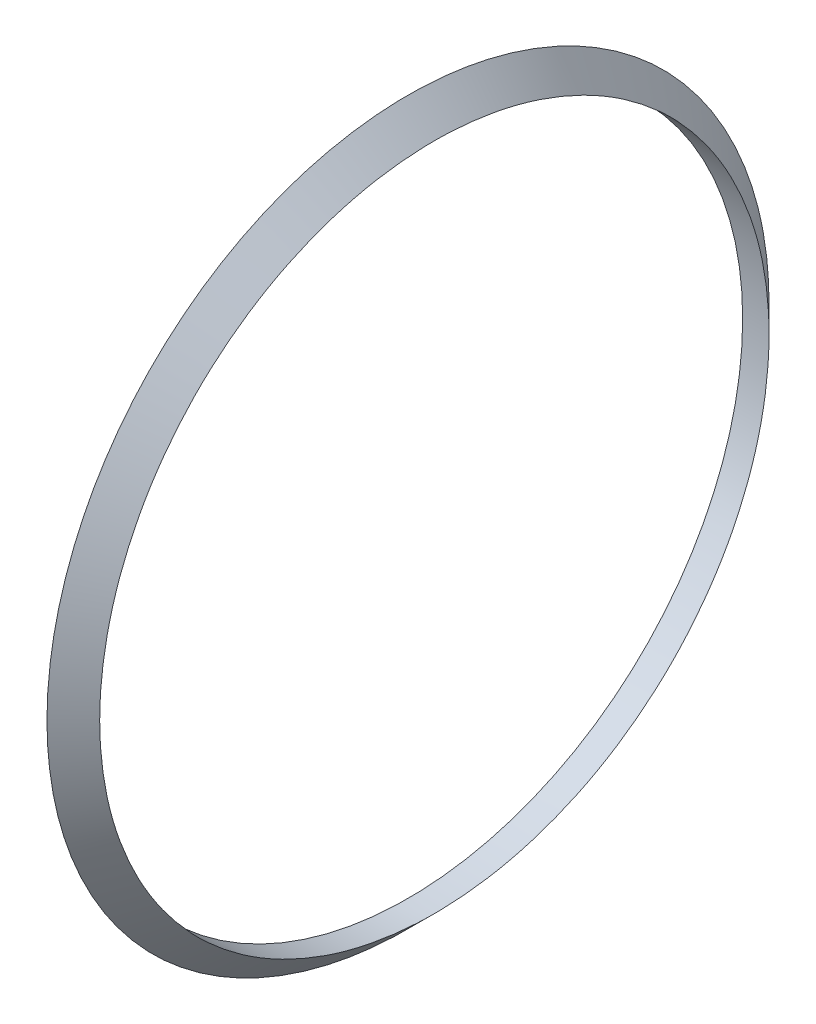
ISO-10303-21;
HEADER;
FILE_DESCRIPTION(('STEP AP214'),'2;1');
FILE_NAME('part.step','',(''),(''),'','','');
FILE_SCHEMA(('AUTOMOTIVE_DESIGN { 1 0 10303 214 1 1 1 1 }'));
ENDSEC;
DATA;
#1=APPLICATION_CONTEXT('core data for automotive mechanical design processes');
#2=APPLICATION_PROTOCOL_DEFINITION('international standard','automotive_design',2000,#1);
#3=PRODUCT_CONTEXT('',#1,'mechanical');
#4=PRODUCT('Part','Part','',(#3));
#5=PRODUCT_RELATED_PRODUCT_CATEGORY('part','',(#4));
#6=PRODUCT_DEFINITION_FORMATION('','',#4);
#7=PRODUCT_DEFINITION_CONTEXT('part definition',#1,'design');
#8=PRODUCT_DEFINITION('design','',#6,#7);
#9=PRODUCT_DEFINITION_SHAPE('','',#8);
#10=(LENGTH_UNIT() NAMED_UNIT(*) SI_UNIT(.MILLI.,.METRE.));
#11=(NAMED_UNIT(*) PLANE_ANGLE_UNIT() SI_UNIT($,.RADIAN.));
#12=(NAMED_UNIT(*) SI_UNIT($,.STERADIAN.) SOLID_ANGLE_UNIT());
#13=UNCERTAINTY_MEASURE_WITH_UNIT(LENGTH_MEASURE(1.E-05),#10,'distance_accuracy_value','');
#14=(GEOMETRIC_REPRESENTATION_CONTEXT(3) GLOBAL_UNCERTAINTY_ASSIGNED_CONTEXT((#13)) GLOBAL_UNIT_ASSIGNED_CONTEXT((#10,
#11,#12)) REPRESENTATION_CONTEXT('',''));
#15=CARTESIAN_POINT('',(0.,0.,0.));
#16=DIRECTION('',(0.,0.,1.));
#17=DIRECTION('',(1.,0.,0.));
#18=AXIS2_PLACEMENT_3D('',#15,#16,#17);
#19=CARTESIAN_POINT('',(-220.063386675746,127.364188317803,34.4393559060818));
#20=DIRECTION('',(-1.,0.,0.));
#21=DIRECTION('',(0.,-0.286994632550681,0.957932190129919));
#22=AXIS2_PLACEMENT_3D('',#19,#20,#21);
#23=PLANE('',#22);
#24=CARTESIAN_POINT('',(-220.063386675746,12.412325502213,109.5));
#25=CARTESIAN_POINT('',(-220.063386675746,13.6958791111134,109.499999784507));
#26=CARTESIAN_POINT('',(-220.063386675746,14.9793636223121,109.477212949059));
#27=CARTESIAN_POINT('',(-220.063386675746,17.5445249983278,109.386464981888));
#28=CARTESIAN_POINT('',(-220.063386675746,18.8262021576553,109.318512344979));
#29=CARTESIAN_POINT('',(-220.063386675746,21.3862711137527,109.13776331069));
#30=CARTESIAN_POINT('',(-220.063386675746,22.6646631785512,109.024970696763));
#31=CARTESIAN_POINT('',(-220.063386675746,25.2167208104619,108.754773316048));
#32=CARTESIAN_POINT('',(-220.063386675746,26.4903863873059,108.597368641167));
#33=CARTESIAN_POINT('',(-220.063386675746,29.0315530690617,108.238084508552));
#34=CARTESIAN_POINT('',(-220.063386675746,30.2990536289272,108.036201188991));
#35=CARTESIAN_POINT('',(-220.063386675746,32.8263719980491,107.587976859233));
#36=CARTESIAN_POINT('',(-220.063386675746,34.08618836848,107.341627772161));
#37=CARTESIAN_POINT('',(-220.063386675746,37.3457442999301,106.644246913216));
#38=CARTESIAN_POINT('',(-220.063386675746,39.338237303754,106.158817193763));
#39=CARTESIAN_POINT('',(-220.063386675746,43.2931812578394,105.076413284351));
#40=CARTESIAN_POINT('',(-220.063386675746,45.2556232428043,104.479406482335));
#41=CARTESIAN_POINT('',(-220.063386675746,49.1441684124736,103.175952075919));
#42=CARTESIAN_POINT('',(-220.063386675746,51.0702682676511,102.469494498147));
#43=CARTESIAN_POINT('',(-220.063386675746,53.9283263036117,101.329522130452));
#44=CARTESIAN_POINT('',(-220.063386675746,54.8763863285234,100.935891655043));
#45=CARTESIAN_POINT('',(-220.063386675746,56.7611412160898,100.122219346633));
#46=CARTESIAN_POINT('',(-220.063386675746,57.6978360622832,99.7021774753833));
#47=CARTESIAN_POINT('',(-220.063386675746,59.5589770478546,98.835986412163));
#48=CARTESIAN_POINT('',(-220.063386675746,60.4834241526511,98.3898392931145));
#49=CARTESIAN_POINT('',(-220.063386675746,62.3193929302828,97.471717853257));
#50=CARTESIAN_POINT('',(-220.063386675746,63.2309147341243,96.9997437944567));
#51=CARTESIAN_POINT('',(-220.063386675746,65.0402598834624,96.0303191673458));
#52=CARTESIAN_POINT('',(-220.063386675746,65.9380838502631,95.5328697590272));
#53=CARTESIAN_POINT('',(-220.063386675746,67.7193674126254,94.5128362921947));
#54=CARTESIAN_POINT('',(-220.063386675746,68.6028264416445,93.9902512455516));
#55=CARTESIAN_POINT('',(-220.063386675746,70.7913853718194,92.6536096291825));
#56=CARTESIAN_POINT('',(-220.063386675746,72.0871088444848,91.8241294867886));
#57=CARTESIAN_POINT('',(-220.063386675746,74.6423861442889,90.111103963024));
#58=CARTESIAN_POINT('',(-220.063386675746,75.9019375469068,89.2275549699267));
#59=CARTESIAN_POINT('',(-220.063386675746,78.3828557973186,87.4083670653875));
#60=CARTESIAN_POINT('',(-220.063386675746,79.6042226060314,86.4727281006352));
#61=CARTESIAN_POINT('',(-220.063386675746,82.0066576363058,84.5511400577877));
#62=CARTESIAN_POINT('',(-220.063386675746,83.1877266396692,83.5651919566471));
#63=CARTESIAN_POINT('',(-220.063386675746,85.5072064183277,81.5447661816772));
#64=CARTESIAN_POINT('',(-220.063386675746,86.6456267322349,80.5102994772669));
#65=CARTESIAN_POINT('',(-220.063386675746,88.3196561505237,78.923278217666));
#66=CARTESIAN_POINT('',(-220.063386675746,88.8720840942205,78.3883653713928));
#67=CARTESIAN_POINT('',(-220.063386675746,89.9654426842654,77.306916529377));
#68=CARTESIAN_POINT('',(-220.063386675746,90.5063733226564,76.7603805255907));
#69=CARTESIAN_POINT('',(-220.063386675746,92.1116154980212,75.103749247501));
#70=CARTESIAN_POINT('',(-220.063386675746,93.158423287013,73.9765871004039));
#71=CARTESIAN_POINT('',(-220.063386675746,95.2036143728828,71.6794131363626));
#72=CARTESIAN_POINT('',(-220.063386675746,96.2020002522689,70.5094036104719));
#73=CARTESIAN_POINT('',(-220.063386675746,98.4748418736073,67.7299894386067));
#74=CARTESIAN_POINT('',(-220.063386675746,99.7298639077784,66.1045806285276));
#75=CARTESIAN_POINT('',(-220.063386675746,101.542484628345,63.6159080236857));
#76=CARTESIAN_POINT('',(-220.063386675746,102.135068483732,62.7778790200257));
#77=CARTESIAN_POINT('',(-220.063386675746,103.296407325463,61.0854694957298));
#78=CARTESIAN_POINT('',(-220.063386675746,103.865162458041,60.2310890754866));
#79=CARTESIAN_POINT('',(-220.063386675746,105.534868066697,57.644397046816));
#80=CARTESIAN_POINT('',(-220.063386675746,106.599383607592,55.888363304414));
#81=CARTESIAN_POINT('',(-220.063386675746,108.627654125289,52.3191789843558));
#82=CARTESIAN_POINT('',(-220.063386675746,109.591407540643,50.5060275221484));
#83=CARTESIAN_POINT('',(-220.063386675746,111.415482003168,46.8282280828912));
#84=CARTESIAN_POINT('',(-220.063386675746,112.275801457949,44.9635793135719));
#85=CARTESIAN_POINT('',(-220.063386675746,113.486876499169,42.1329385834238));
#86=CARTESIAN_POINT('',(-220.063386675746,113.877346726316,41.1837457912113));
#87=CARTESIAN_POINT('',(-220.063386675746,114.631572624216,39.2747414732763));
#88=CARTESIAN_POINT('',(-220.063386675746,114.995327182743,38.3149295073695));
#89=CARTESIAN_POINT('',(-220.063386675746,115.870994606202,35.902651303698));
#90=CARTESIAN_POINT('',(-220.063386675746,116.365961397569,34.4439985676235));
#91=CARTESIAN_POINT('',(-220.063386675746,117.293849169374,31.5070234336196));
#92=CARTESIAN_POINT('',(-220.063386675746,117.726766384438,30.0286998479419));
#93=CARTESIAN_POINT('',(-220.063386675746,118.529653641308,27.0550846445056));
#94=CARTESIAN_POINT('',(-220.063386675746,118.899625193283,25.5597934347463));
#95=CARTESIAN_POINT('',(-220.063386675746,119.575867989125,22.5549054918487));
#96=CARTESIAN_POINT('',(-220.063386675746,119.882140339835,21.0453090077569));
#97=CARTESIAN_POINT('',(-220.063386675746,120.430690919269,18.0145303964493));
#98=CARTESIAN_POINT('',(-220.063386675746,120.672968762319,16.4933481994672));
#99=CARTESIAN_POINT('',(-220.063386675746,121.09348617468,13.4421387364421));
#100=CARTESIAN_POINT('',(-220.063386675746,121.27172496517,11.9121113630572));
#101=CARTESIAN_POINT('',(-220.063386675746,121.563851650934,8.8459385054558));
#102=CARTESIAN_POINT('',(-220.063386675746,121.677739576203,7.30979302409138));
#103=CARTESIAN_POINT('',(-220.063386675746,121.840723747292,4.23403241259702));
#104=CARTESIAN_POINT('',(-220.063386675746,121.889820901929,2.69441733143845));
#105=CARTESIAN_POINT('',(-220.063386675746,121.914361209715,0.385050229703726));
#106=CARTESIAN_POINT('',(-220.063386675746,121.91436406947,-0.384510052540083));
#107=CARTESIAN_POINT('',(-220.063386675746,121.898016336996,-1.92345701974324));
#108=CARTESIAN_POINT('',(-220.063386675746,121.881665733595,-2.69284370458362));
#109=CARTESIAN_POINT('',(-220.063386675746,121.808235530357,-5.00022750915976));
#110=CARTESIAN_POINT('',(-220.063386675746,121.726778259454,-6.53751762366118));
#111=CARTESIAN_POINT('',(-220.063386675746,121.499390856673,-9.60726609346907));
#112=CARTESIAN_POINT('',(-220.063386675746,121.353460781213,-11.1397244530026));
#113=CARTESIAN_POINT('',(-220.063386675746,120.997504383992,-14.197180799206));
#114=CARTESIAN_POINT('',(-220.063386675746,120.787478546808,-15.7221788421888));
#115=CARTESIAN_POINT('',(-220.063386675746,120.303529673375,-18.7619819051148));
#116=CARTESIAN_POINT('',(-220.063386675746,120.029607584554,-20.2767870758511));
#117=CARTESIAN_POINT('',(-220.063386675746,119.417897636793,-23.2934708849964));
#118=CARTESIAN_POINT('',(-220.063386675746,119.080108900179,-24.7953493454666));
#119=CARTESIAN_POINT('',(-220.063386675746,118.341291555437,-27.7834367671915));
#120=CARTESIAN_POINT('',(-220.063386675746,117.940264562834,-29.2696461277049));
#121=CARTESIAN_POINT('',(-220.063386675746,117.075764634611,-32.22380615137));
#122=CARTESIAN_POINT('',(-220.063386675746,116.612289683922,-33.6917562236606));
#123=CARTESIAN_POINT('',(-220.063386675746,115.459460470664,-37.0915245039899));
#124=CARTESIAN_POINT('',(-220.063386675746,114.746239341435,-39.0153005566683));
#125=CARTESIAN_POINT('',(-220.063386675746,113.213361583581,-42.8199354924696));
#126=CARTESIAN_POINT('',(-220.063386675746,112.393703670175,-44.7007938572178));
#127=CARTESIAN_POINT('',(-220.063386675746,110.650196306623,-48.4135383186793));
#128=CARTESIAN_POINT('',(-220.063386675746,109.726348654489,-50.2454252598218));
#129=CARTESIAN_POINT('',(-220.063386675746,107.776885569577,-53.8544382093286));
#130=CARTESIAN_POINT('',(-220.063386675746,106.75126686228,-55.631562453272));
#131=CARTESIAN_POINT('',(-220.063386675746,105.13905173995,-58.2515841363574));
#132=CARTESIAN_POINT('',(-220.063386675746,104.589317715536,-59.1173586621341));
#133=CARTESIAN_POINT('',(-220.063386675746,103.465654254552,-60.8330395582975));
#134=CARTESIAN_POINT('',(-220.063386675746,102.891725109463,-61.6829461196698));
#135=CARTESIAN_POINT('',(-220.063386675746,101.134451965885,-64.2079941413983));
#136=CARTESIAN_POINT('',(-220.063386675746,99.9155302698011,-65.8586133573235));
#137=CARTESIAN_POINT('',(-220.063386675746,97.7028575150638,-68.6861677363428));
#138=CARTESIAN_POINT('',(-220.063386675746,96.7287532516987,-69.8785824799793));
#139=CARTESIAN_POINT('',(-220.063386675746,94.7312609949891,-72.2215877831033));
#140=CARTESIAN_POINT('',(-220.063386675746,93.7078702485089,-73.3721759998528));
#141=CARTESIAN_POINT('',(-220.063386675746,91.6134347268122,-75.6290804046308));
#142=CARTESIAN_POINT('',(-220.063386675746,90.5423908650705,-76.7353974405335));
#143=CARTESIAN_POINT('',(-220.063386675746,88.3542072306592,-78.9014348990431));
#144=CARTESIAN_POINT('',(-220.063386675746,87.237068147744,-79.9611560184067));
#145=CARTESIAN_POINT('',(-220.063386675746,84.9591626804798,-82.0325758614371));
#146=CARTESIAN_POINT('',(-220.063386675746,83.7983968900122,-83.0442752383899));
#147=CARTESIAN_POINT('',(-220.063386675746,81.4354336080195,-85.0180952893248));
#148=CARTESIAN_POINT('',(-220.063386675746,80.2332357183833,-85.9802154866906));
#149=CARTESIAN_POINT('',(-220.063386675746,77.7895577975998,-87.8531959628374));
#150=CARTESIAN_POINT('',(-220.063386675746,76.5480779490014,-88.7640564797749));
#151=CARTESIAN_POINT('',(-220.063386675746,74.0278334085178,-90.5326344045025));
#152=CARTESIAN_POINT('',(-220.063386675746,72.7490690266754,-91.3903522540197));
#153=CARTESIAN_POINT('',(-220.063386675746,70.1555120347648,-93.0513896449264));
#154=CARTESIAN_POINT('',(-220.063386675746,68.8406965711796,-93.854673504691));
#155=CARTESIAN_POINT('',(-220.063386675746,66.1782361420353,-95.4048688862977));
#156=CARTESIAN_POINT('',(-220.063386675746,64.830591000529,-96.1517801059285));
#157=CARTESIAN_POINT('',(-220.063386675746,62.104922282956,-97.5879757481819));
#158=CARTESIAN_POINT('',(-220.063386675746,60.7268984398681,-98.2772596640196));
#159=CARTESIAN_POINT('',(-220.063386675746,57.9430112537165,-99.5971037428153));
#160=CARTESIAN_POINT('',(-220.063386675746,56.5371478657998,-100.227663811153));
#161=CARTESIAN_POINT('',(-220.063386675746,53.7001861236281,-101.429175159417));
#162=CARTESIAN_POINT('',(-220.063386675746,52.2690879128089,-102.000126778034));
#163=CARTESIAN_POINT('',(-220.063386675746,49.3841215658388,-103.081268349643));
#164=CARTESIAN_POINT('',(-220.063386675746,47.9302534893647,-103.591458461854));
#165=CARTESIAN_POINT('',(-220.063386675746,45.0021976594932,-104.549997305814));
#166=CARTESIAN_POINT('',(-220.063386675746,43.5280089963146,-104.998343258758));
#167=CARTESIAN_POINT('',(-220.063386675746,40.5621493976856,-105.832207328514));
#168=CARTESIAN_POINT('',(-220.063386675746,39.0704804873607,-106.217732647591));
#169=CARTESIAN_POINT('',(-220.063386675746,36.0744383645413,-106.924698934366));
#170=CARTESIAN_POINT('',(-220.063386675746,34.5700880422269,-107.246236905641));
#171=CARTESIAN_POINT('',(-220.063386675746,31.5491468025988,-107.825492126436));
#172=CARTESIAN_POINT('',(-220.063386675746,30.0325558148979,-108.083209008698));
#173=CARTESIAN_POINT('',(-220.063386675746,26.9898950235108,-108.534812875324));
#174=CARTESIAN_POINT('',(-220.063386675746,25.4638251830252,-108.728699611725));
#175=CARTESIAN_POINT('',(-220.063386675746,22.4049232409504,-109.052381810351));
#176=CARTESIAN_POINT('',(-220.063386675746,20.8720911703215,-109.182177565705));
#177=CARTESIAN_POINT('',(-220.063386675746,17.8022440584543,-109.377272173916));
#178=CARTESIAN_POINT('',(-220.063386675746,16.2652289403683,-109.442569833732));
#179=CARTESIAN_POINT('',(-220.063386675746,13.9587528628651,-109.491699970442));
#180=CARTESIAN_POINT('',(-220.063386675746,13.1897435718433,-109.499940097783));
#181=CARTESIAN_POINT('',(-220.063386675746,11.6517236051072,-109.500059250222));
#182=CARTESIAN_POINT('',(-220.063386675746,10.8827129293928,-109.491938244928));
#183=CARTESIAN_POINT('',(-220.063386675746,8.57617555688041,-109.44316260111));
#184=CARTESIAN_POINT('',(-220.063386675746,7.03908893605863,-109.378096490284));
#185=CARTESIAN_POINT('',(-220.063386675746,3.96919992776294,-109.183468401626));
#186=CARTESIAN_POINT('',(-220.063386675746,2.43639731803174,-109.053909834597));
#187=CARTESIAN_POINT('',(-220.063386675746,-1.13466524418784,-108.676580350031));
#188=CARTESIAN_POINT('',(-220.063386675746,-3.17036581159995,-108.403755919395));
#189=CARTESIAN_POINT('',(-220.063386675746,-6.20975036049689,-107.909324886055));
#190=CARTESIAN_POINT('',(-220.063386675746,-7.22056380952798,-107.730305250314));
#191=CARTESIAN_POINT('',(-220.063386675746,-9.23676028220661,-107.343840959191));
#192=CARTESIAN_POINT('',(-220.063386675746,-10.2421432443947,-107.136395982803));
#193=CARTESIAN_POINT('',(-220.063386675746,-13.2488460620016,-106.471598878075));
#194=CARTESIAN_POINT('',(-220.063386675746,-15.2409441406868,-105.971748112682));
#195=CARTESIAN_POINT('',(-220.063386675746,-19.1935932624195,-104.860578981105));
#196=CARTESIAN_POINT('',(-220.063386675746,-21.1541450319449,-104.249263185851));
#197=CARTESIAN_POINT('',(-220.063386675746,-25.0379369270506,-102.917289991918));
#198=CARTESIAN_POINT('',(-220.063386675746,-26.9611764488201,-102.196630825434));
#199=CARTESIAN_POINT('',(-220.063386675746,-29.813259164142,-101.035881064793));
#200=CARTESIAN_POINT('',(-220.063386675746,-30.7585183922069,-100.635657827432));
#201=CARTESIAN_POINT('',(-220.063386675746,-32.637521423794,-99.8088437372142));
#202=CARTESIAN_POINT('',(-220.063386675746,-33.571264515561,-99.3822512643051));
#203=CARTESIAN_POINT('',(-220.063386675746,-35.8903701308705,-98.2830838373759));
#204=CARTESIAN_POINT('',(-220.063386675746,-37.2680367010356,-97.5941919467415));
#205=CARTESIAN_POINT('',(-220.063386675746,-39.9929479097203,-96.1588540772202));
#206=CARTESIAN_POINT('',(-220.063386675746,-41.3401935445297,-95.4124099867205));
#207=CARTESIAN_POINT('',(-220.063386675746,-44.0019694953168,-93.8631226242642));
#208=CARTESIAN_POINT('',(-220.063386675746,-45.3164990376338,-93.0602780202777));
#209=CARTESIAN_POINT('',(-220.063386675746,-47.2618112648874,-91.814869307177));
#210=CARTESIAN_POINT('',(-220.063386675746,-47.9058449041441,-91.3928691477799));
#211=CARTESIAN_POINT('',(-220.063386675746,-49.1848466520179,-90.5353256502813));
#212=CARTESIAN_POINT('',(-220.063386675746,-49.8198146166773,-90.0997820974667));
#213=CARTESIAN_POINT('',(-220.063386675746,-51.7107203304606,-88.773232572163));
#214=CARTESIAN_POINT('',(-220.063386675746,-52.9527345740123,-87.8622599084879));
#215=CARTESIAN_POINT('',(-220.063386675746,-55.3974245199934,-85.9890323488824));
#216=CARTESIAN_POINT('',(-220.063386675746,-56.600099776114,-85.0267768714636));
#217=CARTESIAN_POINT('',(-220.063386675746,-58.9640226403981,-83.0526370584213));
#218=CARTESIAN_POINT('',(-220.063386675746,-60.1252702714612,-82.0407527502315));
#219=CARTESIAN_POINT('',(-220.063386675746,-62.4040826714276,-79.9689601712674));
#220=CARTESIAN_POINT('',(-220.063386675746,-63.5216480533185,-78.9090525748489));
#221=CARTESIAN_POINT('',(-220.063386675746,-65.7098815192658,-76.7433847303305));
#222=CARTESIAN_POINT('',(-220.063386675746,-66.7805819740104,-75.6376571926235));
#223=CARTESIAN_POINT('',(-220.063386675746,-68.8743592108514,-73.3819825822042));
#224=CARTESIAN_POINT('',(-220.063386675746,-69.8974353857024,-72.2320349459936));
#225=CARTESIAN_POINT('',(-220.063386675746,-71.8944371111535,-69.8902308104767));
#226=CARTESIAN_POINT('',(-220.063386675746,-72.8683626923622,-68.6983743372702));
#227=CARTESIAN_POINT('',(-220.063386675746,-74.7654033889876,-66.2749048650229));
#228=CARTESIAN_POINT('',(-220.063386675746,-75.6885189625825,-65.0432922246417));
#229=CARTESIAN_POINT('',(-220.063386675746,-77.4821338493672,-62.5423449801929));
#230=CARTESIAN_POINT('',(-220.063386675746,-78.3526337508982,-61.2730107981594));
#231=CARTESIAN_POINT('',(-220.063386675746,-80.0391340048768,-58.6986117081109));
#232=CARTESIAN_POINT('',(-220.063386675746,-80.8551335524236,-57.3935462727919));
#233=CARTESIAN_POINT('',(-220.063386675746,-82.4311833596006,-54.7500940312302));
#234=CARTESIAN_POINT('',(-220.063386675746,-83.1912350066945,-53.4117080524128));
#235=CARTESIAN_POINT('',(-220.063386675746,-84.6541312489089,-50.7040119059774));
#236=CARTESIAN_POINT('',(-220.063386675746,-85.3569739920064,-49.3347007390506));
#237=CARTESIAN_POINT('',(-220.063386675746,-86.9285910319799,-46.1070399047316));
#238=CARTESIAN_POINT('',(-220.063386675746,-87.7747306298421,-44.2376153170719));
#239=CARTESIAN_POINT('',(-220.063386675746,-89.3611540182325,-40.4544130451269));
#240=CARTESIAN_POINT('',(-220.063386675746,-90.1014366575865,-38.5406348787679));
#241=CARTESIAN_POINT('',(-220.063386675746,-91.4734033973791,-34.6745810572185));
#242=CARTESIAN_POINT('',(-220.063386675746,-92.1050893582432,-32.7223060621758));
#243=CARTESIAN_POINT('',(-220.063386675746,-93.2575525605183,-28.7851045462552));
#244=CARTESIAN_POINT('',(-220.063386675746,-93.7783264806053,-26.8001770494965));
#245=CARTESIAN_POINT('',(-220.063386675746,-94.4748848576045,-23.8033473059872));
#246=CARTESIAN_POINT('',(-220.063386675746,-94.6929800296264,-22.8011098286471));
#247=CARTESIAN_POINT('',(-220.063386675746,-95.1008111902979,-20.7909003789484));
#248=CARTESIAN_POINT('',(-220.063386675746,-95.2905475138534,-19.7829284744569));
#249=CARTESIAN_POINT('',(-220.063386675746,-95.8172091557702,-16.7516010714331));
#250=CARTESIAN_POINT('',(-220.063386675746,-96.1116276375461,-14.7206594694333));
#251=CARTESIAN_POINT('',(-220.063386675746,-96.5273558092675,-11.1540102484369));
#252=CARTESIAN_POINT('',(-220.063386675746,-96.6735256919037,-9.62111254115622));
#253=CARTESIAN_POINT('',(-220.063386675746,-96.9013647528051,-6.55033393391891));
#254=CARTESIAN_POINT('',(-220.063386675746,-96.9830303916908,-5.01245276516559));
#255=CARTESIAN_POINT('',(-220.063386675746,-97.05673508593,-2.70419634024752));
#256=CARTESIAN_POINT('',(-220.063386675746,-97.0731708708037,-1.93452366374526));
#257=CARTESIAN_POINT('',(-220.063386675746,-97.0896773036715,-0.395003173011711));
#258=CARTESIAN_POINT('',(-220.063386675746,-97.0897479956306,0.374844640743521));
#259=CARTESIAN_POINT('',(-220.063386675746,-97.0654197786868,2.6840934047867));
#260=CARTESIAN_POINT('',(-220.063386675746,-97.016483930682,4.22330461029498));
#261=CARTESIAN_POINT('',(-220.063386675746,-96.8538577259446,7.29822394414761));
#262=CARTESIAN_POINT('',(-220.063386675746,-96.7401682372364,8.83393211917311));
#263=CARTESIAN_POINT('',(-220.063386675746,-96.448473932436,11.8992526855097));
#264=CARTESIAN_POINT('',(-220.063386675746,-96.2704686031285,13.42886502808));
#265=CARTESIAN_POINT('',(-220.063386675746,-95.8504525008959,16.4792684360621));
#266=CARTESIAN_POINT('',(-220.063386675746,-95.6084420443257,18.0000595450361));
#267=CARTESIAN_POINT('',(-220.063386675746,-95.0604621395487,21.0300695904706));
#268=CARTESIAN_POINT('',(-220.063386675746,-94.7544931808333,22.5392886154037));
#269=CARTESIAN_POINT('',(-220.063386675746,-94.0787624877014,25.5440094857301));
#270=CARTESIAN_POINT('',(-220.063386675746,-93.7089753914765,27.0395056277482));
#271=CARTESIAN_POINT('',(-220.063386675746,-92.9064462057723,30.0135161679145));
#272=CARTESIAN_POINT('',(-220.063386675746,-92.473703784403,31.492030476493));
#273=CARTESIAN_POINT('',(-220.063386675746,-91.5461304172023,34.4294664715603));
#274=CARTESIAN_POINT('',(-220.063386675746,-91.0512988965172,35.8883879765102));
#275=CARTESIAN_POINT('',(-220.063386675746,-90.0005927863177,38.7840798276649));
#276=CARTESIAN_POINT('',(-220.063386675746,-89.4447181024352,40.2208501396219));
#277=CARTESIAN_POINT('',(-220.063386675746,-88.2731663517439,43.0697025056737));
#278=CARTESIAN_POINT('',(-220.063386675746,-87.6574926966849,44.4817859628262));
#279=CARTESIAN_POINT('',(-220.063386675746,-86.3671444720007,47.2789212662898));
#280=CARTESIAN_POINT('',(-220.063386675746,-85.6924635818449,48.6639701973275));
#281=CARTESIAN_POINT('',(-220.063386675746,-84.2851990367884,51.4043178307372));
#282=CARTESIAN_POINT('',(-220.063386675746,-83.5526159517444,52.7596168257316));
#283=CARTESIAN_POINT('',(-220.063386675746,-82.0308446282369,55.4378506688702));
#284=CARTESIAN_POINT('',(-220.063386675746,-81.2416628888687,56.7607892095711));
#285=CARTESIAN_POINT('',(-220.063386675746,-79.6090617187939,59.3702730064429));
#286=CARTESIAN_POINT('',(-220.063386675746,-78.7657171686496,60.6568651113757));
#287=CARTESIAN_POINT('',(-220.063386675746,-77.0254890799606,63.1933195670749));
#288=CARTESIAN_POINT('',(-220.063386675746,-76.1286052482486,64.4431817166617));
#289=CARTESIAN_POINT('',(-220.063386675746,-74.283230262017,66.9042134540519));
#290=CARTESIAN_POINT('',(-220.063386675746,-73.3347389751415,68.1153829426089));
#291=CARTESIAN_POINT('',(-220.063386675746,-71.3878600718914,70.4969127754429));
#292=CARTESIAN_POINT('',(-220.063386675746,-70.3894725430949,71.6672731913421));
#293=CARTESIAN_POINT('',(-220.063386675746,-68.344363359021,73.9650236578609));
#294=CARTESIAN_POINT('',(-220.063386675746,-67.2976423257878,75.0924142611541));
#295=CARTESIAN_POINT('',(-220.063386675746,-65.6925068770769,76.7494058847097));
#296=CARTESIAN_POINT('',(-220.063386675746,-65.1516053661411,77.2960673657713));
#297=CARTESIAN_POINT('',(-220.063386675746,-64.0583012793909,78.3777660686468));
#298=CARTESIAN_POINT('',(-220.063386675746,-63.5058986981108,78.9128032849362));
#299=CARTESIAN_POINT('',(-220.063386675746,-61.8319299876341,80.5002053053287));
#300=CARTESIAN_POINT('',(-220.063386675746,-60.6935385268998,81.5349269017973));
#301=CARTESIAN_POINT('',(-220.063386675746,-58.3743496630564,83.5556412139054));
#302=CARTESIAN_POINT('',(-220.063386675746,-57.1935518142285,84.5416334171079));
#303=CARTESIAN_POINT('',(-220.063386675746,-54.790315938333,86.4644040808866));
#304=CARTESIAN_POINT('',(-220.063386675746,-53.5678319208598,87.4011250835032));
#305=CARTESIAN_POINT('',(-220.063386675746,-51.0845975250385,89.2223755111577));
#306=CARTESIAN_POINT('',(-220.063386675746,-49.8238474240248,90.1069053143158));
#307=CARTESIAN_POINT('',(-220.063386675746,-47.2660377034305,91.8218301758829));
#308=CARTESIAN_POINT('',(-220.063386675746,-45.9689779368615,92.6522250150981));
#309=CARTESIAN_POINT('',(-220.063386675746,-43.3408661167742,94.2573481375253));
#310=CARTESIAN_POINT('',(-220.063386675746,-42.0098141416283,95.0320765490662));
#311=CARTESIAN_POINT('',(-220.063386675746,-39.3158379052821,96.5247224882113));
#312=CARTESIAN_POINT('',(-220.063386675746,-37.9529065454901,97.2426272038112));
#313=CARTESIAN_POINT('',(-220.063386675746,-35.1979296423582,98.6202695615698));
#314=CARTESIAN_POINT('',(-220.063386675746,-33.8058835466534,99.2800060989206));
#315=CARTESIAN_POINT('',(-220.063386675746,-30.9952507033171,100.540337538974));
#316=CARTESIAN_POINT('',(-220.063386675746,-29.5766637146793,101.140931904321));
#317=CARTESIAN_POINT('',(-220.063386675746,-26.7156321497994,102.281955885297));
#318=CARTESIAN_POINT('',(-220.063386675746,-25.2731891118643,102.822389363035));
#319=CARTESIAN_POINT('',(-220.063386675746,-21.8830049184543,104.011642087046));
#320=CARTESIAN_POINT('',(-220.063386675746,-19.9268703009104,104.636670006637));
#321=CARTESIAN_POINT('',(-220.063386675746,-15.9824001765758,105.775485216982));
#322=CARTESIAN_POINT('',(-220.063386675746,-13.9940643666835,106.289271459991));
#323=CARTESIAN_POINT('',(-220.063386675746,-10.9923162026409,106.975162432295));
#324=CARTESIAN_POINT('',(-220.063386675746,-9.98843073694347,107.189677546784));
#325=CARTESIAN_POINT('',(-220.063386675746,-7.97501019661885,107.590293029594));
#326=CARTESIAN_POINT('',(-220.063386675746,-6.96547513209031,107.776393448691));
#327=CARTESIAN_POINT('',(-220.063386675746,-3.9319321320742,108.291682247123));
#328=CARTESIAN_POINT('',(-220.063386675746,-1.90054484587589,108.578415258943));
#329=CARTESIAN_POINT('',(-220.063386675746,2.1747835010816,109.038031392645));
#330=CARTESIAN_POINT('',(-220.063386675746,4.21872371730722,109.210922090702));
#331=CARTESIAN_POINT('',(-220.063386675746,8.31261119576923,109.441889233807));
#332=CARTESIAN_POINT('',(-220.063386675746,10.3625564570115,109.500000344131));
#333=CARTESIAN_POINT('',(-220.063386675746,12.412325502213,109.5));
#334=B_SPLINE_CURVE_WITH_KNOTS('',3,(#24,#25,#26,#27,#28,#29,#30,#31,#32,#33,#34,#35,#36,#37,
#38,#39,#40,#41,#42,#43,#44,#45,#46,#47,#48,#49,#50,#51,#52,#53,#54,#55,#56,#57,#58,#59,#60,#61,
#62,#63,#64,#65,#66,#67,#68,#69,#70,#71,#72,#73,#74,#75,#76,#77,#78,#79,#80,#81,#82,#83,#84,#85,
#86,#87,#88,#89,#90,#91,#92,#93,#94,#95,#96,#97,#98,#99,#100,#101,#102,#103,#104,#105,#106,#107,
#108,#109,#110,#111,#112,#113,#114,#115,#116,#117,#118,#119,#120,#121,#122,#123,#124,#125,#126,
#127,#128,#129,#130,#131,#132,#133,#134,#135,#136,#137,#138,#139,#140,#141,#142,#143,#144,#145,
#146,#147,#148,#149,#150,#151,#152,#153,#154,#155,#156,#157,#158,#159,#160,#161,#162,#163,#164,
#165,#166,#167,#168,#169,#170,#171,#172,#173,#174,#175,#176,#177,#178,#179,#180,#181,#182,#183,
#184,#185,#186,#187,#188,#189,#190,#191,#192,#193,#194,#195,#196,#197,#198,#199,#200,#201,#202,
#203,#204,#205,#206,#207,#208,#209,#210,#211,#212,#213,#214,#215,#216,#217,#218,#219,#220,#221,
#222,#223,#224,#225,#226,#227,#228,#229,#230,#231,#232,#233,#234,#235,#236,#237,#238,#239,#240,
#241,#242,#243,#244,#245,#246,#247,#248,#249,#250,#251,#252,#253,#254,#255,#256,#257,#258,#259,
#260,#261,#262,#263,#264,#265,#266,#267,#268,#269,#270,#271,#272,#273,#274,#275,#276,#277,#278,
#279,#280,#281,#282,#283,#284,#285,#286,#287,#288,#289,#290,#291,#292,#293,#294,#295,#296,#297,
#298,#299,#300,#301,#302,#303,#304,#305,#306,#307,#308,#309,#310,#311,#312,#313,#314,#315,#316,
#317,#318,#319,#320,#321,#322,#323,#324,#325,#326,#327,#328,#329,#330,#331,#332,#333),
.UNSPECIFIED.,.T.,.F.,(4,2,2,2,2,2,2,2,2,2,2,2,2,2,2,2,2,2,2,2,2,2,2,2,2,2,2,2,2,2,2,2,2,2,2,2,
2,2,2,2,2,2,2,2,2,2,2,2,2,2,2,2,2,2,2,2,2,2,2,2,2,2,2,2,2,2,2,2,2,2,2,2,2,2,2,2,2,2,2,2,2,2,2,2,
2,2,2,2,2,2,2,2,2,2,2,2,2,2,2,2,2,2,2,2,2,2,2,2,2,2,2,2,2,2,2,2,2,2,2,2,2,2,2,2,2,2,2,2,2,2,2,2,
2,2,2,2,2,2,2,2,2,2,2,2,2,2,2,2,2,2,2,2,2,2,4),(0.,3.85034283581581,7.69996170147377,
11.5492558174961,15.3985420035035,19.2481625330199,23.0984830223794,29.2472977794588,
35.3979125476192,41.5490881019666,44.6283499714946,47.7076163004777,50.7866384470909,
53.8656293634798,56.944480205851,60.0234521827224,64.6374448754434,69.2517461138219,
73.8660520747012,78.4802684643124,83.0934466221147,85.4001934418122,87.7069418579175,
92.3202487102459,96.9333092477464,103.090255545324,106.169048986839,109.247823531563,
115.404737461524,121.56174678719,127.718850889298,130.7976236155,133.876524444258,
138.496111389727,143.115978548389,147.735734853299,152.355410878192,156.975114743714,
161.594874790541,166.214632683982,170.834325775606,173.142855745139,175.451387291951,
180.068242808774,184.685094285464,189.301910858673,193.91865897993,198.535470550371,
203.152164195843,207.769006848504,213.920834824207,220.072737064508,226.224533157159,
232.376527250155,235.452850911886,238.52913752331,244.681185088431,249.299121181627,
253.917315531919,258.535421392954,263.153458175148,267.77143211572,272.389450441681,
277.007447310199,281.62540578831,286.246362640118,290.867344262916,295.488366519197,
300.109396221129,304.730399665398,309.351391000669,313.97258990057,318.593258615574,
323.206868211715,327.820504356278,332.434158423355,337.047791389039,341.661509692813,
343.968518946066,346.275532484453,350.88939592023,355.503015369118,361.661036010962,
364.740330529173,367.819659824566,373.977637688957,380.135473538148,386.29340895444,
389.372560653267,392.451901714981,397.071359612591,401.690666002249,406.310081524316,
408.619861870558,410.9296788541,415.549047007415,420.16846755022,424.787885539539,
429.407238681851,434.023349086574,438.639518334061,443.255684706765,447.871809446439,
452.487882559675,457.104023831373,461.720050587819,466.336226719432,472.488861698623,
478.641563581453,484.794160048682,490.946940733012,494.023662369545,497.100347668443,
503.25318185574,507.871547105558,512.490165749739,514.799563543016,517.108955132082,
521.727423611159,526.345830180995,530.964273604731,535.582694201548,540.20107945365,
544.821304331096,549.441553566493,554.061845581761,558.682144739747,563.302180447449,
567.922711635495,572.543197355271,577.163153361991,581.776854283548,586.390580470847,
591.004318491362,595.618048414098,600.231718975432,602.538670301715,604.84562272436,
609.459250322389,614.072926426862,618.691868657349,623.310777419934,627.929704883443,
632.548621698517,637.168576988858,641.788620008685,646.40870500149,651.028493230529,
657.185856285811,663.343277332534,666.422567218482,669.501851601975,675.652918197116,
681.803575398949,687.952374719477),.UNSPECIFIED.);
#335=CARTESIAN_POINT('',(-220.063386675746,12.4123255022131,109.5));
#336=VERTEX_POINT('',#335);
#337=EDGE_CURVE('E62',#336,#336,#334,.T.);
#338=ORIENTED_EDGE('',*,*,#337,.T.);
#339=EDGE_LOOP('',(#338));
#340=FACE_BOUND('',#339,.T.);
#341=CARTESIAN_POINT('',(-220.063386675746,12.4123255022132,0.));
#342=DIRECTION('',(-1.,0.,0.));
#343=DIRECTION('',(0.,0.,1.));
#344=AXIS2_PLACEMENT_3D('',#341,#342,#343);
#345=CIRCLE('',#344,101.5);
#346=CARTESIAN_POINT('',(-220.063386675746,12.4123255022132,101.5));
#347=VERTEX_POINT('',#346);
#348=EDGE_CURVE('E72',#347,#347,#345,.T.);
#349=ORIENTED_EDGE('',*,*,#348,.F.);
#350=EDGE_LOOP('',(#349));
#351=FACE_BOUND('',#350,.T.);
#352=ADVANCED_FACE('F55',(#340,#351),#23,.T.);
#353=CARTESIAN_POINT('',(-250.063386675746,12.4123255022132,0.));
#354=DIRECTION('',(-1.,0.,0.));
#355=DIRECTION('',(0.,0.,1.));
#356=AXIS2_PLACEMENT_3D('',#353,#354,#355);
#357=CYLINDRICAL_SURFACE('',#356,101.5);
#358=CARTESIAN_POINT('',(-212.063386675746,12.4123255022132,101.5));
#359=CARTESIAN_POINT('',(-212.063386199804,10.5042943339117,101.50000092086));
#360=CARTESIAN_POINT('',(-212.063885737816,8.59626162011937,101.446187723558));
#361=CARTESIAN_POINT('',(-212.06463749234,4.7865144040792,101.231101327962));
#362=CARTESIAN_POINT('',(-212.064889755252,2.88479878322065,101.069848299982));
#363=CARTESIAN_POINT('',(-212.064790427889,0.0414412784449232,100.747812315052));
#364=CARTESIAN_POINT('',(-212.064677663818,-0.904901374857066,100.627091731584));
#365=CARTESIAN_POINT('',(-212.064332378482,-2.7938347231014,100.359018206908));
#366=CARTESIAN_POINT('',(-212.064099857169,-3.73642541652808,100.211665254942));
#367=CARTESIAN_POINT('',(-212.06359398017,-5.61726848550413,99.8904105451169));
#368=CARTESIAN_POINT('',(-212.063320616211,-6.55551994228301,99.7165034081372));
#369=CARTESIAN_POINT('',(-212.062874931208,-8.42671990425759,99.3423106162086));
#370=CARTESIAN_POINT('',(-212.062702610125,-9.35966841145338,99.1420249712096));
#371=CARTESIAN_POINT('',(-212.062349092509,-12.1424174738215,98.5034378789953));
#372=CARTESIAN_POINT('',(-212.062328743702,-13.9834376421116,98.0261555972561));
#373=CARTESIAN_POINT('',(-212.062583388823,-17.6361083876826,96.9688510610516));
#374=CARTESIAN_POINT('',(-212.062858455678,-19.447751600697,96.3888034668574));
#375=CARTESIAN_POINT('',(-212.063373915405,-23.0357381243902,95.1278125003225));
#376=CARTESIAN_POINT('',(-212.063614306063,-24.8120791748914,94.4468626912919));
#377=CARTESIAN_POINT('',(-212.063595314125,-28.3253892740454,92.9855462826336));
#378=CARTESIAN_POINT('',(-212.06333545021,-30.0623187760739,92.2050846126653));
#379=CARTESIAN_POINT('',(-212.0628138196,-33.489432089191,90.5477856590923));
#380=CARTESIAN_POINT('',(-212.062552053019,-35.1796186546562,89.6709540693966));
#381=CARTESIAN_POINT('',(-212.062321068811,-38.508031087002,87.8236278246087));
#382=CARTESIAN_POINT('',(-212.062351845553,-40.146257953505,86.8531349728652));
#383=CARTESIAN_POINT('',(-212.062830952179,-42.9625519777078,85.0759044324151));
#384=CARTESIAN_POINT('',(-212.063172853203,-44.1531727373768,84.2889707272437));
#385=CARTESIAN_POINT('',(-212.06391383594,-46.5002779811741,82.6655381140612));
#386=CARTESIAN_POINT('',(-212.064312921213,-47.6567603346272,81.8290361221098));
#387=CARTESIAN_POINT('',(-212.064798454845,-49.9334107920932,80.1080236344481));
#388=CARTESIAN_POINT('',(-212.064884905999,-51.0535792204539,79.223513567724));
#389=CARTESIAN_POINT('',(-212.064734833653,-53.2556008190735,77.4080722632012));
#390=CARTESIAN_POINT('',(-212.064498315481,-54.3374546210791,76.4771417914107));
#391=CARTESIAN_POINT('',(-212.063917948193,-56.4607540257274,74.5706650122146));
#392=CARTESIAN_POINT('',(-212.063574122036,-57.502208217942,73.5951282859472));
#393=CARTESIAN_POINT('',(-212.063383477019,-59.0327931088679,72.0996115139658));
#394=CARTESIAN_POINT('',(-212.063374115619,-59.5377365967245,71.5957217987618));
#395=CARTESIAN_POINT('',(-212.063481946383,-60.5368896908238,70.5774101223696));
#396=CARTESIAN_POINT('',(-212.06359913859,-61.0310992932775,70.0629881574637));
#397=CARTESIAN_POINT('',(-212.06400171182,-62.4972784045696,68.5042784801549));
#398=CARTESIAN_POINT('',(-212.064338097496,-63.4528602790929,67.444486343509));
#399=CARTESIAN_POINT('',(-212.064779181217,-65.3184675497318,65.2855979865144));
#400=CARTESIAN_POINT('',(-212.06488387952,-66.2284929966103,64.186501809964));
#401=CARTESIAN_POINT('',(-212.06474453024,-68.0014939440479,61.9508128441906));
#402=CARTESIAN_POINT('',(-212.064500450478,-68.864465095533,60.8142166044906));
#403=CARTESIAN_POINT('',(-212.063816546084,-70.541721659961,58.5056557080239));
#404=CARTESIAN_POINT('',(-212.063376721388,-71.3560070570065,57.3336910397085));
#405=CARTESIAN_POINT('',(-212.062730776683,-72.9344474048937,54.9564737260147));
#406=CARTESIAN_POINT('',(-212.062524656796,-73.6986023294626,53.7512210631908));
#407=CARTESIAN_POINT('',(-212.062342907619,-75.1754220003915,51.3095717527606));
#408=CARTESIAN_POINT('',(-212.062367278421,-75.8880867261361,50.0731750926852));
#409=CARTESIAN_POINT('',(-212.062570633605,-77.2606814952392,47.5713949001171));
#410=CARTESIAN_POINT('',(-212.062749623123,-77.9206097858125,46.3060104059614));
#411=CARTESIAN_POINT('',(-212.063143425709,-79.1865318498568,43.7485443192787));
#412=CARTESIAN_POINT('',(-212.063358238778,-79.7925256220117,42.4564627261));
#413=CARTESIAN_POINT('',(-212.063600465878,-80.9495009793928,39.8479002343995));
#414=CARTESIAN_POINT('',(-212.06362787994,-81.5004825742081,38.5314193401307));
#415=CARTESIAN_POINT('',(-212.063451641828,-82.5464539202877,35.8763990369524));
#416=CARTESIAN_POINT('',(-212.063247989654,-83.0414436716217,34.5378596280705));
#417=CARTESIAN_POINT('',(-212.062849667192,-83.9745438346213,31.8411236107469));
#418=CARTESIAN_POINT('',(-212.062654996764,-84.4126551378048,30.48292731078));
#419=CARTESIAN_POINT('',(-212.062403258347,-85.2312283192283,27.7492725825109));
#420=CARTESIAN_POINT('',(-212.062346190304,-85.6116902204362,26.3738141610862));
#421=CARTESIAN_POINT('',(-212.062446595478,-86.3142883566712,23.6080801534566));
#422=CARTESIAN_POINT('',(-212.062604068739,-86.6364245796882,22.2178045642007));
#423=CARTESIAN_POINT('',(-212.063186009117,-87.2217984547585,19.4249086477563));
#424=CARTESIAN_POINT('',(-212.063610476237,-87.4850361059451,18.0222883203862));
#425=CARTESIAN_POINT('',(-212.064334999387,-87.9521443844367,15.2071992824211));
#426=CARTESIAN_POINT('',(-212.064635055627,-88.1560151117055,13.7947305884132));
#427=CARTESIAN_POINT('',(-212.064890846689,-88.5040276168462,10.9624540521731));
#428=CARTESIAN_POINT('',(-212.064846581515,-88.648169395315,9.54264621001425));
#429=CARTESIAN_POINT('',(-212.064481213,-88.8764676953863,6.69821606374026));
#430=CARTESIAN_POINT('',(-212.064160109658,-88.9606242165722,5.27359375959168));
#431=CARTESIAN_POINT('',(-212.063597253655,-89.0688023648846,2.42206779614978));
#432=CARTESIAN_POINT('',(-212.063355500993,-89.0928239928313,0.995164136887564));
#433=CARTESIAN_POINT('',(-212.06343527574,-89.080689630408,-1.85838936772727));
#434=CARTESIAN_POINT('',(-212.063756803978,-89.0445335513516,-3.28503921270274));
#435=CARTESIAN_POINT('',(-212.064354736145,-88.9121079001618,-6.13554622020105));
#436=CARTESIAN_POINT('',(-212.064631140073,-88.8158383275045,-7.55940338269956));
#437=CARTESIAN_POINT('',(-212.06488324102,-88.5633568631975,-10.4017932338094));
#438=CARTESIAN_POINT('',(-212.064858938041,-88.4071449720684,-11.8203259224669));
#439=CARTESIAN_POINT('',(-212.064476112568,-88.0350566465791,-14.6495444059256));
#440=CARTESIAN_POINT('',(-212.064117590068,-87.8191802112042,-16.0602302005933));
#441=CARTESIAN_POINT('',(-212.063372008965,-87.3281470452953,-18.8712442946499));
#442=CARTESIAN_POINT('',(-212.062984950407,-87.0529904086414,-20.271572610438));
#443=CARTESIAN_POINT('',(-212.062491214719,-86.4438858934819,-23.0593840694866));
#444=CARTESIAN_POINT('',(-212.062384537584,-86.1099380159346,-24.4468672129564));
#445=CARTESIAN_POINT('',(-212.062370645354,-85.3838448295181,-27.2065211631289));
#446=CARTESIAN_POINT('',(-212.062463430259,-84.9916995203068,-28.5786919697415));
#447=CARTESIAN_POINT('',(-212.06276420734,-84.1499087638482,-31.3052813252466));
#448=CARTESIAN_POINT('',(-212.062972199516,-83.7002633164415,-32.6596998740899));
#449=CARTESIAN_POINT('',(-212.063360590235,-82.7442716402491,-35.3483768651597));
#450=CARTESIAN_POINT('',(-212.063540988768,-82.237925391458,-36.6826353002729));
#451=CARTESIAN_POINT('',(-212.063633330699,-81.1694325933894,-39.3286190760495));
#452=CARTESIAN_POINT('',(-212.063545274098,-80.6072860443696,-40.6403444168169));
#453=CARTESIAN_POINT('',(-212.063237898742,-79.4281922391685,-43.2389295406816));
#454=CARTESIAN_POINT('',(-212.063018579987,-78.8112449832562,-44.5257893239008));
#455=CARTESIAN_POINT('',(-212.062643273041,-77.5236467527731,-47.0723551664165));
#456=CARTESIAN_POINT('',(-212.06248728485,-76.8529957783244,-48.3320612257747));
#457=CARTESIAN_POINT('',(-212.062346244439,-75.4591820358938,-50.8220807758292));
#458=CARTESIAN_POINT('',(-212.062361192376,-74.7360192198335,-52.0523942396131));
#459=CARTESIAN_POINT('',(-212.062643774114,-73.2384680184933,-54.4814399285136));
#460=CARTESIAN_POINT('',(-212.062911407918,-72.4640796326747,-55.6801721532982));
#461=CARTESIAN_POINT('',(-212.063613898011,-70.8654550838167,-58.0439230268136));
#462=CARTESIAN_POINT('',(-212.064048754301,-70.041218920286,-59.2089416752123));
#463=CARTESIAN_POINT('',(-212.064658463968,-68.3443613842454,-61.5031968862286));
#464=CARTESIAN_POINT('',(-212.064833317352,-67.4717400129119,-62.6324334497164));
#465=CARTESIAN_POINT('',(-212.064839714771,-65.6796750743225,-64.8531051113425));
#466=CARTESIAN_POINT('',(-212.064671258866,-64.760231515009,-65.944540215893));
#467=CARTESIAN_POINT('',(-212.064154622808,-62.8761152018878,-68.0877102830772));
#468=CARTESIAN_POINT('',(-212.063806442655,-61.9114424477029,-69.1394452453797));
#469=CARTESIAN_POINT('',(-212.063472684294,-60.431887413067,-70.6857814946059));
#470=CARTESIAN_POINT('',(-212.063392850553,-59.9332637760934,-71.1960296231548));
#471=CARTESIAN_POINT('',(-212.063381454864,-58.9253703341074,-72.2059005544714));
#472=CARTESIAN_POINT('',(-212.063449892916,-58.4161005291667,-72.7055233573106));
#473=CARTESIAN_POINT('',(-212.063761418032,-56.8726672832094,-74.1881064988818));
#474=CARTESIAN_POINT('',(-212.064110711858,-55.8228251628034,-75.1548388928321));
#475=CARTESIAN_POINT('',(-212.064642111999,-53.6833525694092,-77.0431520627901));
#476=CARTESIAN_POINT('',(-212.064824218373,-52.5937221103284,-77.9647328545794));
#477=CARTESIAN_POINT('',(-212.064847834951,-50.3765682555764,-79.7611463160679));
#478=CARTESIAN_POINT('',(-212.064689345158,-49.2490448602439,-80.6359789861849));
#479=CARTESIAN_POINT('',(-212.064100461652,-46.9581212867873,-82.3373293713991));
#480=CARTESIAN_POINT('',(-212.06367006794,-45.79472110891,-83.1638470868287));
#481=CARTESIAN_POINT('',(-212.062957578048,-43.4341095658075,-84.7671009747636));
#482=CARTESIAN_POINT('',(-212.062675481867,-42.2368982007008,-85.5438371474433));
#483=CARTESIAN_POINT('',(-212.062369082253,-39.8107937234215,-87.0461460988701));
#484=CARTESIAN_POINT('',(-212.062344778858,-38.5819006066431,-87.7717188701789));
#485=CARTESIAN_POINT('',(-212.062470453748,-36.0946177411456,-89.1704109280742));
#486=CARTESIAN_POINT('',(-212.062620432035,-34.8362279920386,-89.8435302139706));
#487=CARTESIAN_POINT('',(-212.062989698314,-32.2921895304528,-91.136118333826));
#488=CARTESIAN_POINT('',(-212.063208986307,-31.0065408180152,-91.755587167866));
#489=CARTESIAN_POINT('',(-212.063529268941,-28.4102704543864,-92.9397729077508));
#490=CARTESIAN_POINT('',(-212.063630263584,-27.0996488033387,-93.5044898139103));
#491=CARTESIAN_POINT('',(-212.063558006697,-24.4557629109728,-94.5781675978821));
#492=CARTESIAN_POINT('',(-212.063384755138,-23.1224986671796,-95.0871284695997));
#493=CARTESIAN_POINT('',(-212.063001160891,-20.4356984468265,-96.0483891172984));
#494=CARTESIAN_POINT('',(-212.062790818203,-19.0821624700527,-96.5006888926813));
#495=CARTESIAN_POINT('',(-212.062479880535,-16.3572255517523,-97.3478230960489));
#496=CARTESIAN_POINT('',(-212.062379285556,-14.9858246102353,-97.7426575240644));
#497=CARTESIAN_POINT('',(-212.062374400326,-12.2275963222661,-98.4741589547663));
#498=CARTESIAN_POINT('',(-212.062470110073,-10.8407689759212,-98.8108259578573));
#499=CARTESIAN_POINT('',(-212.062941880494,-8.05415429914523,-99.4253938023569));
#500=CARTESIAN_POINT('',(-212.063317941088,-6.65436697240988,-99.7032946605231));
#501=CARTESIAN_POINT('',(-212.064064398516,-3.84432092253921,-100.199836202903));
#502=CARTESIAN_POINT('',(-212.064434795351,-2.43406219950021,-100.418476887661));
#503=CARTESIAN_POINT('',(-212.064845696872,0.394419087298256,-100.796109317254));
#504=CARTESIAN_POINT('',(-212.064886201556,1.81264165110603,-100.955101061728));
#505=CARTESIAN_POINT('',(-212.064661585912,4.65452873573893,-101.213152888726));
#506=CARTESIAN_POINT('',(-212.064396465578,6.07819325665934,-101.312212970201));
#507=CARTESIAN_POINT('',(-212.063797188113,8.92843273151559,-101.450225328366));
#508=CARTESIAN_POINT('',(-212.063463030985,10.3550076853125,-101.489177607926));
#509=CARTESIAN_POINT('',(-212.063346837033,13.208531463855,-101.506905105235));
#510=CARTESIAN_POINT('',(-212.063564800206,14.6354802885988,-101.485680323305));
#511=CARTESIAN_POINT('',(-212.064112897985,17.4872144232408,-101.383091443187));
#512=CARTESIAN_POINT('',(-212.064443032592,18.91199973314,-101.301727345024));
#513=CARTESIAN_POINT('',(-212.064832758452,21.7568734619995,-101.079004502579));
#514=CARTESIAN_POINT('',(-212.064892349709,23.176961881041,-100.937645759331));
#515=CARTESIAN_POINT('',(-212.064666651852,26.0098349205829,-100.595194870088));
#516=CARTESIAN_POINT('',(-212.064381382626,27.4226199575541,-100.394106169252));
#517=CARTESIAN_POINT('',(-212.063665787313,30.2386195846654,-99.9325232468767));
#518=CARTESIAN_POINT('',(-212.063235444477,31.641833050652,-99.6720221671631));
#519=CARTESIAN_POINT('',(-212.062635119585,34.436029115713,-99.0920907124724));
#520=CARTESIAN_POINT('',(-212.062465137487,35.8270117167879,-98.7726603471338));
#521=CARTESIAN_POINT('',(-212.062343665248,38.5941132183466,-98.0754785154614));
#522=CARTESIAN_POINT('',(-212.062392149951,39.9702338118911,-97.697733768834));
#523=CARTESIAN_POINT('',(-212.062631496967,42.7054061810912,-96.884544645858));
#524=CARTESIAN_POINT('',(-212.062822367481,44.0644569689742,-96.4490969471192));
#525=CARTESIAN_POINT('',(-212.063220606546,46.7629923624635,-95.521292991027));
#526=CARTESIAN_POINT('',(-212.063427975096,48.1024769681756,-95.0289367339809));
#527=CARTESIAN_POINT('',(-212.063622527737,50.7594982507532,-93.9881911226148));
#528=CARTESIAN_POINT('',(-212.063609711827,52.0770349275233,-93.4398017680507));
#529=CARTESIAN_POINT('',(-212.063384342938,54.6878175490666,-92.2879650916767));
#530=CARTESIAN_POINT('',(-212.063171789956,55.9810634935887,-91.6845177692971));
#531=CARTESIAN_POINT('',(-212.062775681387,58.5409655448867,-90.4236379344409));
#532=CARTESIAN_POINT('',(-212.062592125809,59.8076216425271,-89.7662054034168));
#533=CARTESIAN_POINT('',(-212.062375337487,62.3120908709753,-88.3985245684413));
#534=CARTESIAN_POINT('',(-212.062342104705,63.5499040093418,-87.6882762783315));
#535=CARTESIAN_POINT('',(-212.062501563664,65.9944870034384,-86.2162264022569));
#536=CARTESIAN_POINT('',(-212.062694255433,67.2012568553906,-85.4544248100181));
#537=CARTESIAN_POINT('',(-212.0633243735,69.5816064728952,-83.8806238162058));
#538=CARTESIAN_POINT('',(-212.063761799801,70.755186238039,-83.0686244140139));
#539=CARTESIAN_POINT('',(-212.064458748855,73.0670719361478,-81.3958686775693));
#540=CARTESIAN_POINT('',(-212.064718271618,74.2053778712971,-80.5351123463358));
#541=CARTESIAN_POINT('',(-212.064888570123,76.4446805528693,-78.7663843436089));
#542=CARTESIAN_POINT('',(-212.064799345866,77.5456772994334,-77.8584126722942));
#543=CARTESIAN_POINT('',(-212.06437805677,79.7084461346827,-75.9968271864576));
#544=CARTESIAN_POINT('',(-212.064045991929,80.7702182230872,-75.0432133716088));
#545=CARTESIAN_POINT('',(-212.063633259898,82.3319524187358,-73.5799213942));
#546=CARTESIAN_POINT('',(-212.063509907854,82.8473903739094,-73.0866647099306));
#547=CARTESIAN_POINT('',(-212.063381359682,83.8677530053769,-72.0893945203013));
#548=CARTESIAN_POINT('',(-212.063376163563,84.372677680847,-71.5853810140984));
#549=CARTESIAN_POINT('',(-212.063535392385,85.8713305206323,-70.0575474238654));
#550=CARTESIAN_POINT('',(-212.063874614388,86.8489957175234,-69.0178797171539));
#551=CARTESIAN_POINT('',(-212.064461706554,88.7595936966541,-66.8982853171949));
#552=CARTESIAN_POINT('',(-212.064709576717,89.692526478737,-65.8183586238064));
#553=CARTESIAN_POINT('',(-212.064887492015,91.5120430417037,-63.6201251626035));
#554=CARTESIAN_POINT('',(-212.064817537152,92.3986268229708,-62.5018183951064));
#555=CARTESIAN_POINT('',(-212.064358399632,94.1238575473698,-60.2288244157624));
#556=CARTESIAN_POINT('',(-212.063969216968,94.962504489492,-59.0741372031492));
#557=CARTESIAN_POINT('',(-212.063224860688,96.5903735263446,-56.7304322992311));
#558=CARTESIAN_POINT('',(-212.062869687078,97.3795956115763,-55.5414146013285));
#559=CARTESIAN_POINT('',(-212.062437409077,98.9072106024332,-53.1311639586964));
#560=CARTESIAN_POINT('',(-212.062360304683,99.6456035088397,-51.9099310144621));
#561=CARTESIAN_POINT('',(-212.062397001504,101.070247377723,-49.437421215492));
#562=CARTESIAN_POINT('',(-212.062510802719,101.75649834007,-48.1861443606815));
#563=CARTESIAN_POINT('',(-212.062838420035,103.075638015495,-45.6557717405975));
#564=CARTESIAN_POINT('',(-212.063052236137,103.70852672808,-44.3766759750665));
#565=CARTESIAN_POINT('',(-212.063425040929,104.919816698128,-41.7929396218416));
#566=CARTESIAN_POINT('',(-212.063584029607,105.498217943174,-40.4882990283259));
#567=CARTESIAN_POINT('',(-212.063620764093,106.599504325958,-37.8557931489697));
#568=CARTESIAN_POINT('',(-212.063498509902,107.122389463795,-36.5279278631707));
#569=CARTESIAN_POINT('',(-212.063157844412,108.111713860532,-33.8513337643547));
#570=CARTESIAN_POINT('',(-212.062939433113,108.578153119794,-32.5026049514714));
#571=CARTESIAN_POINT('',(-212.062582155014,109.453756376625,-29.7866819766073));
#572=CARTESIAN_POINT('',(-212.062443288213,109.862920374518,-28.4194878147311));
#573=CARTESIAN_POINT('',(-212.062345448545,110.623245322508,-25.6690661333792));
#574=CARTESIAN_POINT('',(-212.062386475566,110.97440630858,-24.2858386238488));
#575=CARTESIAN_POINT('',(-212.062734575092,111.618101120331,-21.5058087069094));
#576=CARTESIAN_POINT('',(-212.0630416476,111.910634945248,-20.1090062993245));
#577=CARTESIAN_POINT('',(-212.063768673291,112.436555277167,-17.3043114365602));
#578=CARTESIAN_POINT('',(-212.064188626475,112.669941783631,-15.8964189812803));
#579=CARTESIAN_POINT('',(-212.064738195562,113.077152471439,-13.0720431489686));
#580=CARTESIAN_POINT('',(-212.064867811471,113.250976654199,-11.655559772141));
#581=CARTESIAN_POINT('',(-212.064792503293,113.538753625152,-8.81653717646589));
#582=CARTESIAN_POINT('',(-212.064587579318,113.65270643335,-7.39399795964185));
#583=CARTESIAN_POINT('',(-212.064033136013,113.820537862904,-4.54533354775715));
#584=CARTESIAN_POINT('',(-212.063683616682,113.874416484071,-3.1192083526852));
#585=CARTESIAN_POINT('',(-212.063416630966,113.910108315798,-0.979358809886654));
#586=CARTESIAN_POINT('',(-212.063370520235,113.91448407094,-0.265945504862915));
#587=CARTESIAN_POINT('',(-212.063421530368,113.908194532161,1.16081479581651));
#588=CARTESIAN_POINT('',(-212.063518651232,113.897529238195,1.874161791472));
#589=CARTESIAN_POINT('',(-212.063885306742,113.842973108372,4.01361350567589));
#590=CARTESIAN_POINT('',(-212.064230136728,113.776523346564,5.43920827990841));
#591=CARTESIAN_POINT('',(-212.064718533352,113.583583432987,8.28628456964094));
#592=CARTESIAN_POINT('',(-212.064862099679,113.457093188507,9.70776607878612));
#593=CARTESIAN_POINT('',(-212.064802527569,113.144296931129,12.544145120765));
#594=CARTESIAN_POINT('',(-212.064599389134,112.957990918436,13.9590426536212));
#595=CARTESIAN_POINT('',(-212.063956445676,112.525894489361,16.7797219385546));
#596=CARTESIAN_POINT('',(-212.063516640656,112.280104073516,18.1855036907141));
#597=CARTESIAN_POINT('',(-212.062834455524,111.729475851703,20.9854560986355));
#598=CARTESIAN_POINT('',(-212.062592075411,111.4246380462,22.3796267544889));
#599=CARTESIAN_POINT('',(-212.062350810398,110.756456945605,25.1538773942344));
#600=CARTESIAN_POINT('',(-212.062351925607,110.393113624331,26.5339573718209));
#601=CARTESIAN_POINT('',(-212.062518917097,109.608567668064,29.2775723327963));
#602=CARTESIAN_POINT('',(-212.06268479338,109.187365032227,30.6411073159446));
#603=CARTESIAN_POINT('',(-212.063069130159,108.287849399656,33.3492076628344));
#604=CARTESIAN_POINT('',(-212.063287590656,107.809536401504,34.693773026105));
#605=CARTESIAN_POINT('',(-212.063570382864,106.796650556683,37.3615433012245));
#606=CARTESIAN_POINT('',(-212.063634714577,106.262077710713,38.6847482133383));
#607=CARTESIAN_POINT('',(-212.063507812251,105.13762397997,41.3074417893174));
#608=CARTESIAN_POINT('',(-212.06331657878,104.547743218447,42.6069305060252));
#609=CARTESIAN_POINT('',(-212.062922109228,103.313721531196,45.1798840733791));
#610=CARTESIAN_POINT('',(-212.062718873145,102.669580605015,46.4533489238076));
#611=CARTESIAN_POINT('',(-212.062436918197,101.328184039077,48.9719902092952));
#612=CARTESIAN_POINT('',(-212.062358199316,100.630928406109,50.2171666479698));
#613=CARTESIAN_POINT('',(-212.062405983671,99.1845421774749,52.6770171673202));
#614=CARTESIAN_POINT('',(-212.062532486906,98.4354115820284,53.8916912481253));
#615=CARTESIAN_POINT('',(-212.063063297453,96.8866049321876,56.2883811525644));
#616=CARTESIAN_POINT('',(-212.063467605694,96.0869287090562,57.4703968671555));
#617=CARTESIAN_POINT('',(-212.064208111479,94.4384549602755,59.7996640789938));
#618=CARTESIAN_POINT('',(-212.064544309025,93.5896574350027,60.9469155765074));
#619=CARTESIAN_POINT('',(-212.064876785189,91.8444497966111,63.2046151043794));
#620=CARTESIAN_POINT('',(-212.064873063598,90.9480396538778,64.3150631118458));
#621=CARTESIAN_POINT('',(-212.064574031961,89.109201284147,66.4971802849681));
#622=CARTESIAN_POINT('',(-212.064278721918,88.1667730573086,67.568849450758));
#623=CARTESIAN_POINT('',(-212.06368908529,86.237578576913,69.6714986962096));
#624=CARTESIAN_POINT('',(-212.063394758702,85.2508125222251,70.702478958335));
#625=CARTESIAN_POINT('',(-212.0633792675,83.234692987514,72.7219223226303));
#626=CARTESIAN_POINT('',(-212.063658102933,82.2053395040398,73.710385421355));
#627=CARTESIAN_POINT('',(-212.064240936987,80.1058782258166,75.6430342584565));
#628=CARTESIAN_POINT('',(-212.064544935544,79.0357705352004,76.5872201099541));
#629=CARTESIAN_POINT('',(-212.064865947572,76.8567014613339,78.4296380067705));
#630=CARTESIAN_POINT('',(-212.064882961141,75.7477400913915,79.3278700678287));
#631=CARTESIAN_POINT('',(-212.064575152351,73.4929771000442,81.0767510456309));
#632=CARTESIAN_POINT('',(-212.064250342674,72.3471768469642,81.9274017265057));
#633=CARTESIAN_POINT('',(-212.063513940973,70.020732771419,83.579644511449));
#634=CARTESIAN_POINT('',(-212.063102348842,68.8400889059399,84.3812365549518));
#635=CARTESIAN_POINT('',(-212.062554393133,66.4460427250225,85.9339456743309));
#636=CARTESIAN_POINT('',(-212.062418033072,65.2326399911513,86.6850621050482));
#637=CARTESIAN_POINT('',(-212.062353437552,62.7752539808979,88.1354697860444));
#638=CARTESIAN_POINT('',(-212.062425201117,61.5312708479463,88.8347612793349));
#639=CARTESIAN_POINT('',(-212.062697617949,59.0148287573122,90.1803338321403));
#640=CARTESIAN_POINT('',(-212.062898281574,57.7423675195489,90.8266106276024));
#641=CARTESIAN_POINT('',(-212.063294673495,55.1713074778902,92.0649524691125));
#642=CARTESIAN_POINT('',(-212.063490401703,53.8727082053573,92.6570165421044));
#643=CARTESIAN_POINT('',(-212.063633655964,51.251721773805,93.7858580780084));
#644=CARTESIAN_POINT('',(-212.063581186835,49.929335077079,94.3226366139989));
#645=CARTESIAN_POINT('',(-212.06331087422,47.2632185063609,95.3399234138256));
#646=CARTESIAN_POINT('',(-212.063093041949,45.9194900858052,95.8204354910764));
#647=CARTESIAN_POINT('',(-212.062652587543,42.8413352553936,96.8485006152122));
#648=CARTESIAN_POINT('',(-212.062445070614,41.1009315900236,97.3782388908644));
#649=CARTESIAN_POINT('',(-212.062336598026,37.5941532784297,98.3434419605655));
#650=CARTESIAN_POINT('',(-212.062435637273,35.8277790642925,98.7789083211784));
#651=CARTESIAN_POINT('',(-212.062896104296,33.1627232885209,99.3604455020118));
#652=CARTESIAN_POINT('',(-212.063101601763,32.2717298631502,99.54235710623));
#653=CARTESIAN_POINT('',(-212.063569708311,30.4851807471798,99.8821741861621));
#654=CARTESIAN_POINT('',(-212.06383231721,29.5896250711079,100.04007973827));
#655=CARTESIAN_POINT('',(-212.064511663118,26.898808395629,100.477320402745));
#656=CARTESIAN_POINT('',(-212.06482068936,25.0975491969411,100.720582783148));
#657=CARTESIAN_POINT('',(-212.064851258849,21.484744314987,101.11005164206));
#658=CARTESIAN_POINT('',(-212.064572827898,19.6731990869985,101.256262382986));
#659=CARTESIAN_POINT('',(-212.063840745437,16.0452108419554,101.451226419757));
#660=CARTESIAN_POINT('',(-212.063387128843,14.2287688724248,101.499999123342));
#661=CARTESIAN_POINT('',(-212.063386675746,12.4123255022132,101.5));
#662=B_SPLINE_CURVE_WITH_KNOTS('',3,(#358,#359,#360,#361,#362,#363,#364,#365,#366,#367,#368,
#369,#370,#371,#372,#373,#374,#375,#376,#377,#378,#379,#380,#381,#382,#383,#384,#385,#386,#387,
#388,#389,#390,#391,#392,#393,#394,#395,#396,#397,#398,#399,#400,#401,#402,#403,#404,#405,#406,
#407,#408,#409,#410,#411,#412,#413,#414,#415,#416,#417,#418,#419,#420,#421,#422,#423,#424,#425,
#426,#427,#428,#429,#430,#431,#432,#433,#434,#435,#436,#437,#438,#439,#440,#441,#442,#443,#444,
#445,#446,#447,#448,#449,#450,#451,#452,#453,#454,#455,#456,#457,#458,#459,#460,#461,#462,#463,
#464,#465,#466,#467,#468,#469,#470,#471,#472,#473,#474,#475,#476,#477,#478,#479,#480,#481,#482,
#483,#484,#485,#486,#487,#488,#489,#490,#491,#492,#493,#494,#495,#496,#497,#498,#499,#500,#501,
#502,#503,#504,#505,#506,#507,#508,#509,#510,#511,#512,#513,#514,#515,#516,#517,#518,#519,#520,
#521,#522,#523,#524,#525,#526,#527,#528,#529,#530,#531,#532,#533,#534,#535,#536,#537,#538,#539,
#540,#541,#542,#543,#544,#545,#546,#547,#548,#549,#550,#551,#552,#553,#554,#555,#556,#557,#558,
#559,#560,#561,#562,#563,#564,#565,#566,#567,#568,#569,#570,#571,#572,#573,#574,#575,#576,#577,
#578,#579,#580,#581,#582,#583,#584,#585,#586,#587,#588,#589,#590,#591,#592,#593,#594,#595,#596,
#597,#598,#599,#600,#601,#602,#603,#604,#605,#606,#607,#608,#609,#610,#611,#612,#613,#614,#615,
#616,#617,#618,#619,#620,#621,#622,#623,#624,#625,#626,#627,#628,#629,#630,#631,#632,#633,#634,
#635,#636,#637,#638,#639,#640,#641,#642,#643,#644,#645,#646,#647,#648,#649,#650,#651,#652,#653,
#654,#655,#656,#657,#658,#659,#660,#661),.UNSPECIFIED.,.T.,.F.,(4,2,2,2,2,2,2,2,2,2,2,2,2,2,2,2,
2,2,2,2,2,2,2,2,2,2,2,2,2,2,2,2,2,2,2,2,2,2,2,2,2,2,2,2,2,2,2,2,2,2,2,2,2,2,2,2,2,2,2,2,2,2,2,2,
2,2,2,2,2,2,2,2,2,2,2,2,2,2,2,2,2,2,2,2,2,2,2,2,2,2,2,2,2,2,2,2,2,2,2,2,2,2,2,2,2,2,2,2,2,2,2,2,
2,2,2,2,2,2,2,2,2,2,2,2,2,2,2,2,2,2,2,2,2,2,2,2,2,2,2,2,2,2,2,2,2,2,2,2,2,2,2,4),(0.,
5.72339155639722,11.4457089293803,14.3074317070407,17.1691556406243,20.0314600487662,
22.8937633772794,28.5961350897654,34.299914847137,40.0040586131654,45.7136933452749,
51.4229909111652,57.132178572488,61.4125261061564,65.6931402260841,69.9737161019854,
74.2542213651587,78.5338114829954,80.6737342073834,82.8136576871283,87.0932445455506,
91.3728266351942,95.652803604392,99.9327819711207,104.212762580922,108.492744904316,
112.772869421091,117.052994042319,121.333117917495,125.61324178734,129.893298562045,
134.173353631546,138.453409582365,142.733465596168,147.013514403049,151.293563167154,
155.573611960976,159.853660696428,164.133715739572,168.413770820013,172.693825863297,
176.973880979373,181.253929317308,185.533977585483,189.81402587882,194.094074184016,
198.37412399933,202.654173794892,206.93422356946,211.214273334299,215.494327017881,
219.774380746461,224.054434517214,228.334488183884,232.614541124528,236.894594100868,
239.034739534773,241.174884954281,245.454937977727,249.734989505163,254.015040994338,
258.295092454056,262.575143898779,266.855195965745,271.135248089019,275.415300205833,
279.695352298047,283.975404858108,288.25545746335,292.535510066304,296.815562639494,
301.095613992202,305.375665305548,309.655716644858,313.935768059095,318.215819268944,
322.495870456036,326.775921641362,331.05597275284,335.335777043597,339.61607561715,
343.896373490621,348.176178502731,352.456230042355,356.736281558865,361.01633309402,
365.29638467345,369.576437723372,373.856489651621,378.136542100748,382.416594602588,
386.696646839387,390.976699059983,395.256751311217,397.39689626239,399.537041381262,
403.817092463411,408.097143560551,412.377194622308,416.65724577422,420.937297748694,
425.217349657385,429.497401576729,433.777453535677,438.057506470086,442.337559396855,
446.617612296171,450.897665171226,455.177715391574,459.457765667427,463.737815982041,
468.017866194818,472.297914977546,476.577963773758,478.718107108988,480.858250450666,
485.13829930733,489.418354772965,493.698410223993,497.978465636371,502.258521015,
506.538578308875,510.818635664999,515.098693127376,519.378750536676,523.658798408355,
527.938846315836,532.218893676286,536.498941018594,540.779002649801,545.059064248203,
549.339128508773,553.619192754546,557.89923780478,562.179283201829,566.459317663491,
570.739350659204,575.019224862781,579.299104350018,583.579038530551,587.858952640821,
592.139210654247,596.419545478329,600.699797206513,604.979758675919,610.434804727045,
615.889760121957,618.617596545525,621.345424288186,626.795411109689,632.245158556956,
637.693820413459),.UNSPECIFIED.);
#663=CARTESIAN_POINT('',(-212.063386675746,12.4123255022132,101.5));
#664=VERTEX_POINT('',#663);
#665=EDGE_CURVE('E11',#664,#664,#662,.T.);
#666=ORIENTED_EDGE('',*,*,#665,.T.);
#667=EDGE_LOOP('',(#666));
#668=FACE_BOUND('',#667,.T.);
#669=ORIENTED_EDGE('',*,*,#348,.T.);
#670=EDGE_LOOP('',(#669));
#671=FACE_BOUND('',#670,.T.);
#672=ADVANCED_FACE('F76',(#668,#671),#357,.F.);
#673=CARTESIAN_POINT('',(-211.983386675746,12.4123255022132,101.42));
#674=CARTESIAN_POINT('',(-211.983386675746,19.0967308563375,101.42));
#675=CARTESIAN_POINT('',(-211.983386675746,32.4655415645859,100.085280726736));
#676=CARTESIAN_POINT('',(-211.983386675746,51.468722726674,94.2904838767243));
#677=CARTESIAN_POINT('',(-211.983386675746,69.0035411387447,84.950745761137));
#678=CARTESIAN_POINT('',(-211.983386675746,84.5989897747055,72.1866642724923));
#679=CARTESIAN_POINT('',(-211.983386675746,97.3630712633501,56.5912156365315));
#680=CARTESIAN_POINT('',(-211.983386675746,106.702809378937,39.0563972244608));
#681=CARTESIAN_POINT('',(-211.983386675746,112.497606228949,20.0532160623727));
#682=CARTESIAN_POINT('',(-211.983386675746,114.499685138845,0.));
#683=CARTESIAN_POINT('',(-211.983386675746,112.497606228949,-20.0532160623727));
#684=CARTESIAN_POINT('',(-211.983386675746,106.702809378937,-39.0563972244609));
#685=CARTESIAN_POINT('',(-211.983386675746,97.3630712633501,-56.5912156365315));
#686=CARTESIAN_POINT('',(-211.983386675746,84.5989897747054,-72.1866642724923));
#687=CARTESIAN_POINT('',(-211.983386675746,69.0035411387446,-84.9507457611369));
#688=CARTESIAN_POINT('',(-211.983386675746,51.4687227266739,-94.2904838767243));
#689=CARTESIAN_POINT('',(-211.983386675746,32.4655415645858,-100.085280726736));
#690=CARTESIAN_POINT('',(-211.983386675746,12.4123255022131,-102.087359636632));
#691=CARTESIAN_POINT('',(-211.983386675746,-7.64089056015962,-100.085280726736));
#692=CARTESIAN_POINT('',(-211.983386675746,-26.6440717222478,-94.2904838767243));
#693=CARTESIAN_POINT('',(-211.983386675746,-44.1788901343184,-84.9507457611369));
#694=CARTESIAN_POINT('',(-211.983386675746,-59.7743387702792,-72.1866642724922));
#695=CARTESIAN_POINT('',(-211.983386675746,-72.5384202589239,-56.5912156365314));
#696=CARTESIAN_POINT('',(-211.983386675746,-81.8781583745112,-39.0563972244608));
#697=CARTESIAN_POINT('',(-211.983386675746,-87.6729552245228,-20.0532160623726));
#698=CARTESIAN_POINT('',(-211.983386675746,-89.6750341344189,1.3553600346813E-13));
#699=CARTESIAN_POINT('',(-211.983386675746,-87.6729552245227,20.0532160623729));
#700=CARTESIAN_POINT('',(-211.983386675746,-81.8781583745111,39.056397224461));
#701=CARTESIAN_POINT('',(-211.983386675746,-72.5384202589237,56.5912156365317));
#702=CARTESIAN_POINT('',(-211.983386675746,-59.7743387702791,72.1866642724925));
#703=CARTESIAN_POINT('',(-211.983386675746,-44.1788901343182,84.9507457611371));
#704=CARTESIAN_POINT('',(-211.983386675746,-26.6440717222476,94.2904838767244));
#705=CARTESIAN_POINT('',(-211.983386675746,-7.64089056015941,100.085280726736));
#706=CARTESIAN_POINT('',(-211.983386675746,5.72792014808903,101.42));
#707=CARTESIAN_POINT('',(-211.983386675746,12.4123255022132,101.42));
#708=CARTESIAN_POINT('',(-212.010053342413,12.4123255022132,101.446666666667));
#709=CARTESIAN_POINT('',(-212.010053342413,19.0984884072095,101.446666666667));
#710=CARTESIAN_POINT('',(-212.010053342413,32.470814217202,100.111596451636));
#711=CARTESIAN_POINT('',(-212.010053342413,51.4789919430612,94.3152759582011));
#712=CARTESIAN_POINT('',(-212.010053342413,69.0184208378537,84.9730821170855));
#713=CARTESIAN_POINT('',(-212.010053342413,84.6179700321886,72.2056445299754));
#714=CARTESIAN_POINT('',(-212.010053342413,97.3854076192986,56.6060953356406));
#715=CARTESIAN_POINT('',(-212.010053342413,106.727601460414,39.066666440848));
#716=CARTESIAN_POINT('',(-212.010053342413,112.523921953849,20.0584887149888));
#717=CARTESIAN_POINT('',(-212.010053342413,114.526527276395,0.));
#718=CARTESIAN_POINT('',(-212.010053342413,112.523921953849,-20.0584887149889));
#719=CARTESIAN_POINT('',(-212.010053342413,106.727601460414,-39.066666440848));
#720=CARTESIAN_POINT('',(-212.010053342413,97.3854076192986,-56.6060953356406));
#721=CARTESIAN_POINT('',(-212.010053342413,84.6179700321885,-72.2056445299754));
#722=CARTESIAN_POINT('',(-212.010053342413,69.0184208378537,-84.9730821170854));
#723=CARTESIAN_POINT('',(-212.010053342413,51.4789919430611,-94.3152759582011));
#724=CARTESIAN_POINT('',(-212.010053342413,32.470814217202,-100.111596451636));
#725=CARTESIAN_POINT('',(-212.010053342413,12.4123255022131,-102.114201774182));
#726=CARTESIAN_POINT('',(-212.010053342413,-7.64616321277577,-100.111596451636));
#727=CARTESIAN_POINT('',(-212.010053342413,-26.6543409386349,-94.3152759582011));
#728=CARTESIAN_POINT('',(-212.010053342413,-44.1937698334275,-84.9730821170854));
#729=CARTESIAN_POINT('',(-212.010053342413,-59.7933190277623,-72.2056445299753));
#730=CARTESIAN_POINT('',(-212.010053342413,-72.5607566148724,-56.6060953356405));
#731=CARTESIAN_POINT('',(-212.010053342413,-81.902950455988,-39.0666664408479));
#732=CARTESIAN_POINT('',(-212.010053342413,-87.699270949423,-20.0584887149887));
#733=CARTESIAN_POINT('',(-212.010053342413,-89.7018762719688,1.35168625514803E-13));
#734=CARTESIAN_POINT('',(-212.010053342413,-87.699270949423,20.058488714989));
#735=CARTESIAN_POINT('',(-212.010053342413,-81.9029504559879,39.0666664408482));
#736=CARTESIAN_POINT('',(-212.010053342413,-72.5607566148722,56.6060953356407));
#737=CARTESIAN_POINT('',(-212.010053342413,-59.7933190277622,72.2056445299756));
#738=CARTESIAN_POINT('',(-212.010053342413,-44.1937698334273,84.9730821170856));
#739=CARTESIAN_POINT('',(-212.010053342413,-26.6543409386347,94.3152759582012));
#740=CARTESIAN_POINT('',(-212.010053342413,-7.64616321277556,100.111596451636));
#741=CARTESIAN_POINT('',(-212.010053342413,5.72616259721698,101.446666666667));
#742=CARTESIAN_POINT('',(-212.010053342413,12.4123255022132,101.446666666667));
#743=CARTESIAN_POINT('',(-212.03672000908,12.4123255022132,101.473333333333));
#744=CARTESIAN_POINT('',(-212.03672000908,19.1002459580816,101.473333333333));
#745=CARTESIAN_POINT('',(-212.03672000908,32.4760868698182,100.137912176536));
#746=CARTESIAN_POINT('',(-212.03672000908,51.4892611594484,94.3400680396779));
#747=CARTESIAN_POINT('',(-212.03672000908,69.0333005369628,84.995418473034));
#748=CARTESIAN_POINT('',(-212.03672000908,84.6369502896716,72.2246247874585));
#749=CARTESIAN_POINT('',(-212.03672000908,97.4077439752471,56.6209750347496));
#750=CARTESIAN_POINT('',(-212.03672000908,106.752393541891,39.0769356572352));
#751=CARTESIAN_POINT('',(-212.036720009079,112.55023767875,20.063761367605));
#752=CARTESIAN_POINT('',(-212.03672000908,114.553369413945,0.));
#753=CARTESIAN_POINT('',(-212.036720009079,112.55023767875,-20.063761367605));
#754=CARTESIAN_POINT('',(-212.03672000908,106.752393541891,-39.0769356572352));
#755=CARTESIAN_POINT('',(-212.036720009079,97.4077439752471,-56.6209750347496));
#756=CARTESIAN_POINT('',(-212.03672000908,84.6369502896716,-72.2246247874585));
#757=CARTESIAN_POINT('',(-212.03672000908,69.0333005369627,-84.995418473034));
#758=CARTESIAN_POINT('',(-212.03672000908,51.4892611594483,-94.3400680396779));
#759=CARTESIAN_POINT('',(-212.03672000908,32.4760868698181,-100.137912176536));
#760=CARTESIAN_POINT('',(-212.03672000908,12.4123255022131,-102.141043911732));
#761=CARTESIAN_POINT('',(-212.03672000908,-7.65143586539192,-100.137912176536));
#762=CARTESIAN_POINT('',(-212.03672000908,-26.6646101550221,-94.3400680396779));
#763=CARTESIAN_POINT('',(-212.036720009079,-44.2086495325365,-84.9954184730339));
#764=CARTESIAN_POINT('',(-212.03672000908,-59.8122992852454,-72.2246247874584));
#765=CARTESIAN_POINT('',(-212.03672000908,-72.5830929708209,-56.6209750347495));
#766=CARTESIAN_POINT('',(-212.03672000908,-81.9277425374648,-39.0769356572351));
#767=CARTESIAN_POINT('',(-212.03672000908,-87.7255866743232,-20.0637613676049));
#768=CARTESIAN_POINT('',(-212.03672000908,-89.7287184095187,1.34801247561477E-13));
#769=CARTESIAN_POINT('',(-212.036720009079,-87.7255866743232,20.0637613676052));
#770=CARTESIAN_POINT('',(-212.03672000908,-81.9277425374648,39.0769356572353));
#771=CARTESIAN_POINT('',(-212.03672000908,-72.5830929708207,56.6209750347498));
#772=CARTESIAN_POINT('',(-212.03672000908,-59.8122992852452,72.2246247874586));
#773=CARTESIAN_POINT('',(-212.03672000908,-44.2086495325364,84.9954184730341));
#774=CARTESIAN_POINT('',(-212.03672000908,-26.6646101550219,94.340068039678));
#775=CARTESIAN_POINT('',(-212.03672000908,-7.65143586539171,100.137912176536));
#776=CARTESIAN_POINT('',(-212.03672000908,5.72440504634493,101.473333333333));
#777=CARTESIAN_POINT('',(-212.03672000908,12.4123255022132,101.473333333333));
#778=CARTESIAN_POINT('',(-212.063386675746,12.4123255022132,101.5));
#779=CARTESIAN_POINT('',(-212.063386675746,19.1020035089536,101.5));
#780=CARTESIAN_POINT('',(-212.063386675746,32.4813595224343,100.164227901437));
#781=CARTESIAN_POINT('',(-212.063386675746,51.4995303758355,94.3648601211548));
#782=CARTESIAN_POINT('',(-212.063386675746,69.0481802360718,85.0177548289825));
#783=CARTESIAN_POINT('',(-212.063386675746,84.6559305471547,72.2436050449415));
#784=CARTESIAN_POINT('',(-212.063386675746,97.4300803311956,56.6358547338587));
#785=CARTESIAN_POINT('',(-212.063386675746,106.777185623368,39.0872048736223));
#786=CARTESIAN_POINT('',(-212.063386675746,112.57655340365,20.0690340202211));
#787=CARTESIAN_POINT('',(-212.063386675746,114.580211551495,0.));
#788=CARTESIAN_POINT('',(-212.063386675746,112.57655340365,-20.0690340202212));
#789=CARTESIAN_POINT('',(-212.063386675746,106.777185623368,-39.0872048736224));
#790=CARTESIAN_POINT('',(-212.063386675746,97.4300803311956,-56.6358547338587));
#791=CARTESIAN_POINT('',(-212.063386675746,84.6559305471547,-72.2436050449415));
#792=CARTESIAN_POINT('',(-212.063386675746,69.0481802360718,-85.0177548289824));
#793=CARTESIAN_POINT('',(-212.063386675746,51.4995303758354,-94.3648601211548));
#794=CARTESIAN_POINT('',(-212.063386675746,32.4813595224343,-100.164227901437));
#795=CARTESIAN_POINT('',(-212.063386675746,12.4123255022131,-102.167886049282));
#796=CARTESIAN_POINT('',(-212.063386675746,-7.65670851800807,-100.164227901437));
#797=CARTESIAN_POINT('',(-212.063386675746,-26.6748793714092,-94.3648601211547));
#798=CARTESIAN_POINT('',(-212.063386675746,-44.2235292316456,-85.0177548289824));
#799=CARTESIAN_POINT('',(-212.063386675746,-59.8312795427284,-72.2436050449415));
#800=CARTESIAN_POINT('',(-212.063386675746,-72.6054293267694,-56.6358547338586));
#801=CARTESIAN_POINT('',(-212.063386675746,-81.9525346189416,-39.0872048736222));
#802=CARTESIAN_POINT('',(-212.063386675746,-87.7519023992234,-20.069034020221));
#803=CARTESIAN_POINT('',(-212.063386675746,-89.7555605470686,1.34433869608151E-13));
#804=CARTESIAN_POINT('',(-212.063386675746,-87.7519023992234,20.0690340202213));
#805=CARTESIAN_POINT('',(-212.063386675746,-81.9525346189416,39.0872048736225));
#806=CARTESIAN_POINT('',(-212.063386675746,-72.6054293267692,56.6358547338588));
#807=CARTESIAN_POINT('',(-212.063386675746,-59.8312795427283,72.2436050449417));
#808=CARTESIAN_POINT('',(-212.063386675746,-44.2235292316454,85.0177548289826));
#809=CARTESIAN_POINT('',(-212.063386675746,-26.674879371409,94.3648601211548));
#810=CARTESIAN_POINT('',(-212.063386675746,-7.65670851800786,100.164227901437));
#811=CARTESIAN_POINT('',(-212.063386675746,5.72264749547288,101.5));
#812=CARTESIAN_POINT('',(-212.063386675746,12.4123255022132,101.5));
#813=CARTESIAN_POINT('',(-214.730053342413,12.4123255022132,104.166666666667));
#814=CARTESIAN_POINT('',(-214.730053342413,19.2777585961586,104.166666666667));
#815=CARTESIAN_POINT('',(-214.730053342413,33.0086247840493,102.795800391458));
#816=CARTESIAN_POINT('',(-214.730053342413,52.5264520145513,96.844068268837));
#817=CARTESIAN_POINT('',(-214.730053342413,70.5361501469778,87.2513904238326));
#818=CARTESIAN_POINT('',(-214.730053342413,86.5539562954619,74.1416307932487));
#819=CARTESIAN_POINT('',(-214.730053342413,99.6637159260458,58.1238246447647));
#820=CARTESIAN_POINT('',(-214.730053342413,109.25639377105,40.1141265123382));
#821=CARTESIAN_POINT('',(-214.730053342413,115.208125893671,20.5962992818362));
#822=CARTESIAN_POINT('',(-214.730053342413,117.264425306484,0.));
#823=CARTESIAN_POINT('',(-214.730053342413,115.208125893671,-20.5962992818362));
#824=CARTESIAN_POINT('',(-214.730053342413,109.25639377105,-40.1141265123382));
#825=CARTESIAN_POINT('',(-214.730053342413,99.6637159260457,-58.1238246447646));
#826=CARTESIAN_POINT('',(-214.730053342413,86.5539562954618,-74.1416307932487));
#827=CARTESIAN_POINT('',(-214.730053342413,70.5361501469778,-87.2513904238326));
#828=CARTESIAN_POINT('',(-214.730053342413,52.5264520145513,-96.844068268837));
#829=CARTESIAN_POINT('',(-214.730053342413,33.0086247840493,-102.795800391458));
#830=CARTESIAN_POINT('',(-214.730053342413,12.4123255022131,-104.852099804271));
#831=CARTESIAN_POINT('',(-214.730053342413,-8.18397377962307,-102.795800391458));
#832=CARTESIAN_POINT('',(-214.730053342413,-27.7018010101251,-96.844068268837));
#833=CARTESIAN_POINT('',(-214.730053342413,-45.7114991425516,-87.2513904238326));
#834=CARTESIAN_POINT('',(-214.730053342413,-61.7293052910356,-74.1416307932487));
#835=CARTESIAN_POINT('',(-214.730053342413,-74.8390649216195,-58.1238246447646));
#836=CARTESIAN_POINT('',(-214.730053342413,-84.4317427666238,-40.1141265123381));
#837=CARTESIAN_POINT('',(-214.730053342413,-90.3834748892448,-20.5962992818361));
#838=CARTESIAN_POINT('',(-214.730053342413,-92.4397743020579,0.));
#839=CARTESIAN_POINT('',(-214.730053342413,-90.3834748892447,20.5962992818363));
#840=CARTESIAN_POINT('',(-214.730053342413,-84.4317427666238,40.1141265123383));
#841=CARTESIAN_POINT('',(-214.730053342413,-74.8390649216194,58.1238246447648));
#842=CARTESIAN_POINT('',(-214.730053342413,-61.7293052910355,74.1416307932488));
#843=CARTESIAN_POINT('',(-214.730053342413,-45.7114991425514,87.2513904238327));
#844=CARTESIAN_POINT('',(-214.730053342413,-27.7018010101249,96.844068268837));
#845=CARTESIAN_POINT('',(-214.730053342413,-8.18397377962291,102.795800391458));
#846=CARTESIAN_POINT('',(-214.730053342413,5.54689240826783,104.166666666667));
#847=CARTESIAN_POINT('',(-214.730053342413,12.4123255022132,104.166666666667));
#848=CARTESIAN_POINT('',(-217.39672000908,12.4123255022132,106.833333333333));
#849=CARTESIAN_POINT('',(-217.39672000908,19.4535136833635,106.833333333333));
#850=CARTESIAN_POINT('',(-217.39672000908,33.5358900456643,105.427372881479));
#851=CARTESIAN_POINT('',(-217.39672000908,53.5533736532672,99.3232764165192));
#852=CARTESIAN_POINT('',(-217.39672000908,72.0241200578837,89.4850260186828));
#853=CARTESIAN_POINT('',(-217.39672000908,88.451982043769,76.0396565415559));
#854=CARTESIAN_POINT('',(-217.39672000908,101.897351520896,59.6117945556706));
#855=CARTESIAN_POINT('',(-217.39672000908,111.735601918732,41.141048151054));
#856=CARTESIAN_POINT('',(-217.39672000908,117.839698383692,21.1235645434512));
#857=CARTESIAN_POINT('',(-217.39672000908,119.948639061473,0.));
#858=CARTESIAN_POINT('',(-217.39672000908,117.839698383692,-21.1235645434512));
#859=CARTESIAN_POINT('',(-217.39672000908,111.735601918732,-41.141048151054));
#860=CARTESIAN_POINT('',(-217.39672000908,101.897351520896,-59.6117945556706));
#861=CARTESIAN_POINT('',(-217.39672000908,88.451982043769,-76.0396565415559));
#862=CARTESIAN_POINT('',(-217.39672000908,72.0241200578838,-89.4850260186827));
#863=CARTESIAN_POINT('',(-217.39672000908,53.5533736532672,-99.3232764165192));
#864=CARTESIAN_POINT('',(-217.39672000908,33.5358900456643,-105.427372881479));
#865=CARTESIAN_POINT('',(-217.39672000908,12.4123255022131,-107.53631355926));
#866=CARTESIAN_POINT('',(-217.39672000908,-8.71123904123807,-105.427372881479));
#867=CARTESIAN_POINT('',(-217.39672000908,-28.7287226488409,-99.3232764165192));
#868=CARTESIAN_POINT('',(-217.39672000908,-47.1994690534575,-89.4850260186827));
#869=CARTESIAN_POINT('',(-217.39672000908,-63.6273310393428,-76.0396565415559));
#870=CARTESIAN_POINT('',(-217.39672000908,-77.0727005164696,-59.6117945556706));
#871=CARTESIAN_POINT('',(-217.39672000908,-86.9109509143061,-41.141048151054));
#872=CARTESIAN_POINT('',(-217.39672000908,-93.0150473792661,-21.1235645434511));
#873=CARTESIAN_POINT('',(-217.39672000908,-95.1239880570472,0.));
#874=CARTESIAN_POINT('',(-217.39672000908,-93.0150473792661,21.1235645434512));
#875=CARTESIAN_POINT('',(-217.39672000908,-86.910950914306,41.1410481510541));
#876=CARTESIAN_POINT('',(-217.39672000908,-77.0727005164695,59.6117945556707));
#877=CARTESIAN_POINT('',(-217.39672000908,-63.6273310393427,76.039656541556));
#878=CARTESIAN_POINT('',(-217.39672000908,-47.1994690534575,89.4850260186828));
#879=CARTESIAN_POINT('',(-217.39672000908,-28.7287226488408,99.3232764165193));
#880=CARTESIAN_POINT('',(-217.39672000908,-8.71123904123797,105.427372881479));
#881=CARTESIAN_POINT('',(-217.39672000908,5.37113732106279,106.833333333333));
#882=CARTESIAN_POINT('',(-217.39672000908,12.4123255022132,106.833333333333));
#883=CARTESIAN_POINT('',(-220.063386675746,12.4123255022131,109.5));
#884=CARTESIAN_POINT('',(-220.063386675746,19.6292687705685,109.5));
#885=CARTESIAN_POINT('',(-220.063386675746,34.0631553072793,108.058945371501));
#886=CARTESIAN_POINT('',(-220.063386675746,54.580295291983,101.802484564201));
#887=CARTESIAN_POINT('',(-220.063386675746,73.5120899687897,91.7186616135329));
#888=CARTESIAN_POINT('',(-220.063386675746,90.3500077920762,77.9376822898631));
#889=CARTESIAN_POINT('',(-220.063386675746,104.130987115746,61.0997644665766));
#890=CARTESIAN_POINT('',(-220.063386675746,114.214810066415,42.1679697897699));
#891=CARTESIAN_POINT('',(-220.063386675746,120.471270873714,21.6508298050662));
#892=CARTESIAN_POINT('',(-220.063386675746,122.632852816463,0.));
#893=CARTESIAN_POINT('',(-220.063386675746,120.471270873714,-21.6508298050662));
#894=CARTESIAN_POINT('',(-220.063386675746,114.214810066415,-42.1679697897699));
#895=CARTESIAN_POINT('',(-220.063386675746,104.130987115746,-61.0997644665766));
#896=CARTESIAN_POINT('',(-220.063386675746,90.3500077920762,-77.937682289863));
#897=CARTESIAN_POINT('',(-220.063386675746,73.5120899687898,-91.7186616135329));
#898=CARTESIAN_POINT('',(-220.063386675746,54.580295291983,-101.802484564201));
#899=CARTESIAN_POINT('',(-220.063386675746,34.0631553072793,-108.058945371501));
#900=CARTESIAN_POINT('',(-220.063386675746,12.4123255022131,-110.22052731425));
#901=CARTESIAN_POINT('',(-220.063386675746,-9.23850430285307,-108.058945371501));
#902=CARTESIAN_POINT('',(-220.063386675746,-29.7556442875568,-101.802484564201));
#903=CARTESIAN_POINT('',(-220.063386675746,-48.6874389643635,-91.7186616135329));
#904=CARTESIAN_POINT('',(-220.063386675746,-65.52535678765,-77.9376822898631));
#905=CARTESIAN_POINT('',(-220.063386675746,-79.3063361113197,-61.0997644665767));
#906=CARTESIAN_POINT('',(-220.063386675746,-89.3901590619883,-42.1679697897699));
#907=CARTESIAN_POINT('',(-220.063386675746,-95.6466198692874,-21.6508298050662));
#908=CARTESIAN_POINT('',(-220.063386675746,-97.8082018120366,0.));
#909=CARTESIAN_POINT('',(-220.063386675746,-95.6466198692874,21.6508298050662));
#910=CARTESIAN_POINT('',(-220.063386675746,-89.3901590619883,42.1679697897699));
#911=CARTESIAN_POINT('',(-220.063386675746,-79.3063361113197,61.0997644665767));
#912=CARTESIAN_POINT('',(-220.063386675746,-65.5253567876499,77.9376822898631));
#913=CARTESIAN_POINT('',(-220.063386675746,-48.6874389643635,91.7186616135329));
#914=CARTESIAN_POINT('',(-220.063386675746,-29.7556442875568,101.802484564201));
#915=CARTESIAN_POINT('',(-220.063386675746,-9.23850430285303,108.058945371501));
#916=CARTESIAN_POINT('',(-220.063386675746,5.19538223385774,109.5));
#917=CARTESIAN_POINT('',(-220.063386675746,12.4123255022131,109.5));
#918=B_SPLINE_SURFACE_WITH_KNOTS('',3,3,((#673,#674,#675,#676,#677,#678,#679,#680,#681,#682,
#683,#684,#685,#686,#687,#688,#689,#690,#691,#692,#693,#694,#695,#696,#697,#698,#699,#700,#701,
#702,#703,#704,#705,#706,#707),(#708,#709,#710,#711,#712,#713,#714,#715,#716,#717,#718,#719,
#720,#721,#722,#723,#724,#725,#726,#727,#728,#729,#730,#731,#732,#733,#734,#735,#736,#737,#738,
#739,#740,#741,#742),(#743,#744,#745,#746,#747,#748,#749,#750,#751,#752,#753,#754,#755,#756,
#757,#758,#759,#760,#761,#762,#763,#764,#765,#766,#767,#768,#769,#770,#771,#772,#773,#774,#775,
#776,#777),(#778,#779,#780,#781,#782,#783,#784,#785,#786,#787,#788,#789,#790,#791,#792,#793,
#794,#795,#796,#797,#798,#799,#800,#801,#802,#803,#804,#805,#806,#807,#808,#809,#810,#811,#812),
(#813,#814,#815,#816,#817,#818,#819,#820,#821,#822,#823,#824,#825,#826,#827,#828,#829,#830,#831,
#832,#833,#834,#835,#836,#837,#838,#839,#840,#841,#842,#843,#844,#845,#846,#847),(#848,#849,
#850,#851,#852,#853,#854,#855,#856,#857,#858,#859,#860,#861,#862,#863,#864,#865,#866,#867,#868,
#869,#870,#871,#872,#873,#874,#875,#876,#877,#878,#879,#880,#881,#882),(#883,#884,#885,#886,
#887,#888,#889,#890,#891,#892,#893,#894,#895,#896,#897,#898,#899,#900,#901,#902,#903,#904,#905,
#906,#907,#908,#909,#910,#911,#912,#913,#914,#915,#916,#917)),.UNSPECIFIED.,.F.,.T.,.F.,(4,3,4),
(4,1,1,1,1,1,1,1,1,1,1,1,1,1,1,1,1,1,1,1,1,1,1,1,1,1,1,1,1,1,1,1,4),(-0.01,0.,1.),(0.,0.03125,
0.0625,0.09375,0.125,0.15625,0.1875,0.21875,0.25,0.28125,0.3125,0.34375,0.375,0.40625,0.4375,
0.46875,0.5,0.53125,0.5625,0.59375,0.625,0.65625,0.6875,0.71875,0.75,0.78125,0.8125,0.84375,
0.875,0.90625,0.9375,0.96875,1.),.UNSPECIFIED.);
#919=CARTESIAN_POINT('',(-212.063386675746,12.4123255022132,101.5));
#920=CARTESIAN_POINT('',(-212.14672000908,12.4123255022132,101.583333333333));
#921=CARTESIAN_POINT('',(-212.230053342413,12.4123255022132,101.666666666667));
#922=CARTESIAN_POINT('',(-212.39672000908,12.4123255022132,101.833333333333));
#923=CARTESIAN_POINT('',(-212.480053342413,12.4123255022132,101.916666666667));
#924=CARTESIAN_POINT('',(-212.64672000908,12.4123255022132,102.083333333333));
#925=CARTESIAN_POINT('',(-212.730053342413,12.4123255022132,102.166666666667));
#926=CARTESIAN_POINT('',(-212.89672000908,12.4123255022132,102.333333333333));
#927=CARTESIAN_POINT('',(-212.980053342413,12.4123255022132,102.416666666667));
#928=CARTESIAN_POINT('',(-213.14672000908,12.4123255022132,102.583333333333));
#929=CARTESIAN_POINT('',(-213.230053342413,12.4123255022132,102.666666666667));
#930=CARTESIAN_POINT('',(-213.39672000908,12.4123255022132,102.833333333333));
#931=CARTESIAN_POINT('',(-213.480053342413,12.4123255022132,102.916666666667));
#932=CARTESIAN_POINT('',(-213.64672000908,12.4123255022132,103.083333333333));
#933=CARTESIAN_POINT('',(-213.730053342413,12.4123255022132,103.166666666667));
#934=CARTESIAN_POINT('',(-213.89672000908,12.4123255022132,103.333333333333));
#935=CARTESIAN_POINT('',(-213.980053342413,12.4123255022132,103.416666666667));
#936=CARTESIAN_POINT('',(-214.14672000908,12.4123255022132,103.583333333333));
#937=CARTESIAN_POINT('',(-214.230053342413,12.4123255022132,103.666666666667));
#938=CARTESIAN_POINT('',(-214.39672000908,12.4123255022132,103.833333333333));
#939=CARTESIAN_POINT('',(-214.480053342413,12.4123255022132,103.916666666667));
#940=CARTESIAN_POINT('',(-214.64672000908,12.4123255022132,104.083333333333));
#941=CARTESIAN_POINT('',(-214.730053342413,12.4123255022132,104.166666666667));
#942=CARTESIAN_POINT('',(-214.89672000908,12.4123255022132,104.333333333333));
#943=CARTESIAN_POINT('',(-214.980053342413,12.4123255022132,104.416666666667));
#944=CARTESIAN_POINT('',(-215.14672000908,12.4123255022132,104.583333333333));
#945=CARTESIAN_POINT('',(-215.230053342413,12.4123255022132,104.666666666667));
#946=CARTESIAN_POINT('',(-215.39672000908,12.4123255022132,104.833333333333));
#947=CARTESIAN_POINT('',(-215.480053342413,12.4123255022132,104.916666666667));
#948=CARTESIAN_POINT('',(-215.64672000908,12.4123255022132,105.083333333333));
#949=CARTESIAN_POINT('',(-215.730053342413,12.4123255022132,105.166666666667));
#950=CARTESIAN_POINT('',(-215.89672000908,12.4123255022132,105.333333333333));
#951=CARTESIAN_POINT('',(-215.980053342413,12.4123255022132,105.416666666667));
#952=CARTESIAN_POINT('',(-216.14672000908,12.4123255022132,105.583333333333));
#953=CARTESIAN_POINT('',(-216.230053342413,12.4123255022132,105.666666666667));
#954=CARTESIAN_POINT('',(-216.39672000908,12.4123255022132,105.833333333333));
#955=CARTESIAN_POINT('',(-216.480053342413,12.4123255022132,105.916666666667));
#956=CARTESIAN_POINT('',(-216.64672000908,12.4123255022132,106.083333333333));
#957=CARTESIAN_POINT('',(-216.730053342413,12.4123255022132,106.166666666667));
#958=CARTESIAN_POINT('',(-216.89672000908,12.4123255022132,106.333333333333));
#959=CARTESIAN_POINT('',(-216.980053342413,12.4123255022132,106.416666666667));
#960=CARTESIAN_POINT('',(-217.14672000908,12.4123255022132,106.583333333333));
#961=CARTESIAN_POINT('',(-217.230053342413,12.4123255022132,106.666666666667));
#962=CARTESIAN_POINT('',(-217.39672000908,12.4123255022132,106.833333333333));
#963=CARTESIAN_POINT('',(-217.480053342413,12.4123255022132,106.916666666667));
#964=CARTESIAN_POINT('',(-217.64672000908,12.4123255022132,107.083333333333));
#965=CARTESIAN_POINT('',(-217.730053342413,12.4123255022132,107.166666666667));
#966=CARTESIAN_POINT('',(-217.89672000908,12.4123255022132,107.333333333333));
#967=CARTESIAN_POINT('',(-217.980053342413,12.4123255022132,107.416666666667));
#968=CARTESIAN_POINT('',(-218.14672000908,12.4123255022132,107.583333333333));
#969=CARTESIAN_POINT('',(-218.230053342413,12.4123255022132,107.666666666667));
#970=CARTESIAN_POINT('',(-218.39672000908,12.4123255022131,107.833333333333));
#971=CARTESIAN_POINT('',(-218.480053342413,12.4123255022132,107.916666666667));
#972=CARTESIAN_POINT('',(-218.64672000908,12.4123255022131,108.083333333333));
#973=CARTESIAN_POINT('',(-218.730053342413,12.4123255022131,108.166666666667));
#974=CARTESIAN_POINT('',(-218.89672000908,12.4123255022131,108.333333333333));
#975=CARTESIAN_POINT('',(-218.980053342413,12.4123255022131,108.416666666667));
#976=CARTESIAN_POINT('',(-219.14672000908,12.4123255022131,108.583333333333));
#977=CARTESIAN_POINT('',(-219.230053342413,12.4123255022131,108.666666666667));
#978=CARTESIAN_POINT('',(-219.39672000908,12.4123255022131,108.833333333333));
#979=CARTESIAN_POINT('',(-219.480053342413,12.4123255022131,108.916666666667));
#980=CARTESIAN_POINT('',(-219.64672000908,12.4123255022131,109.083333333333));
#981=CARTESIAN_POINT('',(-219.730053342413,12.4123255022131,109.166666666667));
#982=CARTESIAN_POINT('',(-219.89672000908,12.4123255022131,109.333333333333));
#983=CARTESIAN_POINT('',(-219.980053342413,12.4123255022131,109.416666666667));
#984=CARTESIAN_POINT('',(-220.063386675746,12.4123255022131,109.5));
#985=B_SPLINE_CURVE_WITH_KNOTS('',3,(#919,#920,#921,#922,#923,#924,#925,#926,#927,#928,#929,
#930,#931,#932,#933,#934,#935,#936,#937,#938,#939,#940,#941,#942,#943,#944,#945,#946,#947,#948,
#949,#950,#951,#952,#953,#954,#955,#956,#957,#958,#959,#960,#961,#962,#963,#964,#965,#966,#967,
#968,#969,#970,#971,#972,#973,#974,#975,#976,#977,#978,#979,#980,#981,#982,#983,#984),
.UNSPECIFIED.,.F.,.F.,(4,2,2,2,2,2,2,2,2,2,2,2,2,2,2,2,2,2,2,2,2,2,2,2,2,2,2,2,2,2,2,2,4),(0.,
0.353553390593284,0.707106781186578,1.06066017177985,1.41421356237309,1.76776695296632,
2.12132034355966,2.47487373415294,2.82842712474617,3.18198051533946,3.53553390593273,
3.88908729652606,4.24264068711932,4.59619407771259,4.94974746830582,5.3033008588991,
5.65685424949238,6.01040764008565,6.36396103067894,6.71751442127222,7.07106781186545,
7.42462120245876,7.77817459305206,8.1317279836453,8.48528137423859,8.83883476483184,
9.1923881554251,9.54594154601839,9.89949493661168,10.253048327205,10.6066017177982,
10.9601551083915,11.3137084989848),.UNSPECIFIED.);
#986=EDGE_CURVE('BSEAM57',#664,#336,#985,.T.);
#987=ORIENTED_EDGE('',*,*,#665,.F.);
#988=ORIENTED_EDGE('',*,*,#337,.F.);
#989=ORIENTED_EDGE('',*,*,#986,.T.);
#990=ORIENTED_EDGE('',*,*,#986,.F.);
#991=EDGE_LOOP('',(#987,#989,#988,#990));
#992=FACE_BOUND('',#991,.T.);
#993=ADVANCED_FACE('F57',(#992),#918,.F.);
#994=CLOSED_SHELL('',(#352,#672,#993));
#995=MANIFOLD_SOLID_BREP('B2',#994);
#996=ADVANCED_BREP_SHAPE_REPRESENTATION('',(#18,#995),#14);
#997=SHAPE_DEFINITION_REPRESENTATION(#9,#996);
ENDSEC;
END-ISO-10303-21;
